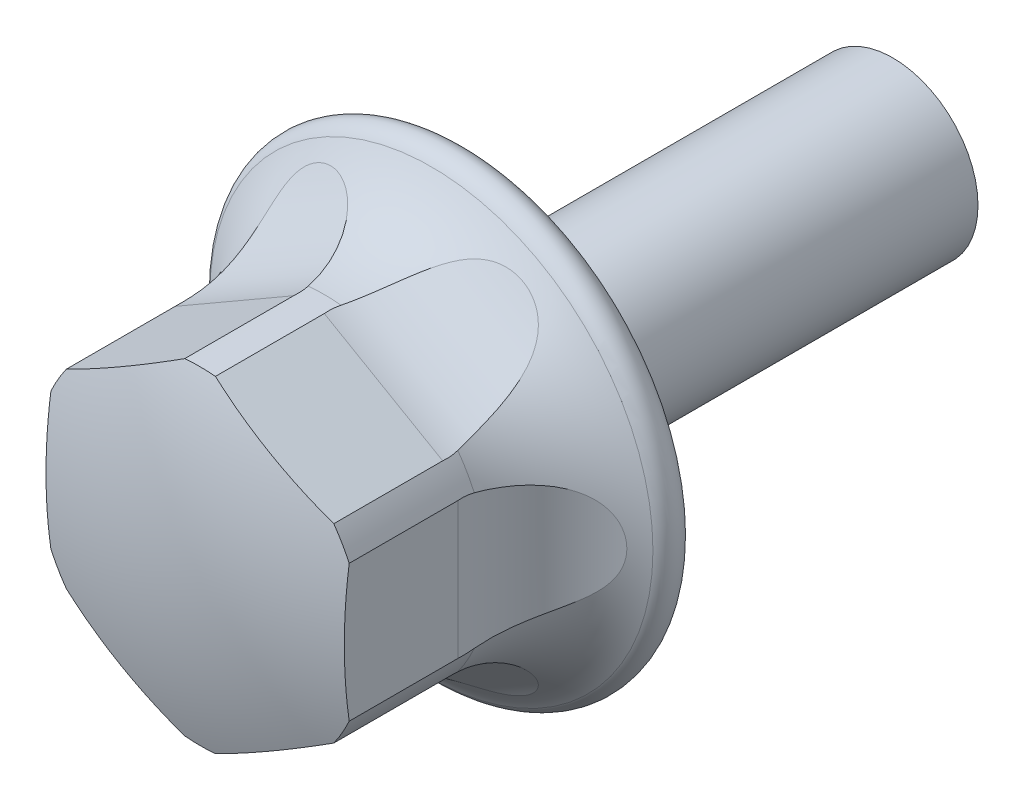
ISO-10303-21;
HEADER;
FILE_DESCRIPTION(('STEP AP214'),'2;1');
FILE_NAME('part.step','',(''),(''),'','','');
FILE_SCHEMA(('AUTOMOTIVE_DESIGN { 1 0 10303 214 1 1 1 1 }'));
ENDSEC;
DATA;
#1=APPLICATION_CONTEXT('core data for automotive mechanical design processes');
#2=APPLICATION_PROTOCOL_DEFINITION('international standard','automotive_design',2000,#1);
#3=PRODUCT_CONTEXT('',#1,'mechanical');
#4=PRODUCT('Part','Part','',(#3));
#5=PRODUCT_RELATED_PRODUCT_CATEGORY('part','',(#4));
#6=PRODUCT_DEFINITION_FORMATION('','',#4);
#7=PRODUCT_DEFINITION_CONTEXT('part definition',#1,'design');
#8=PRODUCT_DEFINITION('design','',#6,#7);
#9=PRODUCT_DEFINITION_SHAPE('','',#8);
#10=(LENGTH_UNIT() NAMED_UNIT(*) SI_UNIT(.MILLI.,.METRE.));
#11=(NAMED_UNIT(*) PLANE_ANGLE_UNIT() SI_UNIT($,.RADIAN.));
#12=(NAMED_UNIT(*) SI_UNIT($,.STERADIAN.) SOLID_ANGLE_UNIT());
#13=UNCERTAINTY_MEASURE_WITH_UNIT(LENGTH_MEASURE(1.E-05),#10,'distance_accuracy_value','');
#14=(GEOMETRIC_REPRESENTATION_CONTEXT(3) GLOBAL_UNCERTAINTY_ASSIGNED_CONTEXT((#13)) GLOBAL_UNIT_ASSIGNED_CONTEXT((#10,
#11,#12)) REPRESENTATION_CONTEXT('',''));
#15=CARTESIAN_POINT('',(0.,0.,0.));
#16=DIRECTION('',(0.,0.,1.));
#17=DIRECTION('',(1.,0.,0.));
#18=AXIS2_PLACEMENT_3D('',#15,#16,#17);
#19=CARTESIAN_POINT('',(0.,0.,0.));
#20=DIRECTION('',(0.,0.,1.));
#21=DIRECTION('',(1.,0.,0.));
#22=AXIS2_PLACEMENT_3D('',#19,#20,#21);
#23=CYLINDRICAL_SURFACE('',#22,3.85);
#24=DIRECTION('',(0.,0.,1.));
#25=VECTOR('',#24,1.);
#26=CARTESIAN_POINT('',(0.360980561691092,3.8330396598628,0.));
#27=LINE('',#26,#25);
#28=CARTESIAN_POINT('',(0.360980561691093,3.8330396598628,3.7));
#29=VERTEX_POINT('',#28);
#30=CARTESIAN_POINT('',(0.360980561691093,3.8330396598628,6.25454860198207));
#31=VERTEX_POINT('',#30);
#32=EDGE_CURVE('E282',#29,#31,#27,.T.);
#33=ORIENTED_EDGE('',*,*,#32,.F.);
#34=CARTESIAN_POINT('',(3.14133213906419,2.22587789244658,3.6));
#35=CARTESIAN_POINT('',(3.14132972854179,2.22588680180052,3.67209261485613));
#36=CARTESIAN_POINT('',(3.13772805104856,2.23099205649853,3.74427829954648));
#37=CARTESIAN_POINT('',(3.12329618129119,2.25114755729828,3.8866251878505));
#38=CARTESIAN_POINT('',(3.11244895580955,2.26622123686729,3.95678121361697));
#39=CARTESIAN_POINT('',(3.0835648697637,2.30536630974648,4.09278988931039));
#40=CARTESIAN_POINT('',(3.06554520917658,2.3294161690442,4.15865239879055));
#41=CARTESIAN_POINT('',(3.02242675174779,2.38509307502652,4.28453173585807));
#42=CARTESIAN_POINT('',(2.99733125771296,2.4167165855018,4.344551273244));
#43=CARTESIAN_POINT('',(2.93955899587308,2.48668377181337,4.45899291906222));
#44=CARTESIAN_POINT('',(2.90670406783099,2.52517918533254,4.51323167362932));
#45=CARTESIAN_POINT('',(2.834218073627,2.60627411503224,4.61347454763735));
#46=CARTESIAN_POINT('',(2.79458433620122,2.64887524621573,4.65947540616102));
#47=CARTESIAN_POINT('',(2.70521902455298,2.74020561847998,4.74668734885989));
#48=CARTESIAN_POINT('',(2.65489561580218,2.7891390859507,4.78707640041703));
#49=CARTESIAN_POINT('',(2.5477903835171,2.88730860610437,4.85760178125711));
#50=CARTESIAN_POINT('',(2.49100544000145,2.93654479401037,4.88773312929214));
#51=CARTESIAN_POINT('',(2.36485016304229,3.03930226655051,4.94098195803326));
#52=CARTESIAN_POINT('',(2.29478688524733,3.09263171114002,4.96282947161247));
#53=CARTESIAN_POINT('',(2.14930325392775,3.19545725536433,4.994345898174));
#54=CARTESIAN_POINT('',(2.07388008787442,3.2449513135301,5.0040083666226));
#55=CARTESIAN_POINT('',(1.91182641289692,3.34323636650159,5.01171324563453));
#56=CARTESIAN_POINT('',(1.82481601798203,3.39150087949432,5.00854732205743));
#57=CARTESIAN_POINT('',(1.64867265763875,3.48053494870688,4.98772705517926));
#58=CARTESIAN_POINT('',(1.55953898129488,3.52130195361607,4.97006779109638));
#59=CARTESIAN_POINT('',(1.3806473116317,3.59524964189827,4.9194149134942));
#60=CARTESIAN_POINT('',(1.29090203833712,3.62829894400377,4.88618119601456));
#61=CARTESIAN_POINT('',(1.11607614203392,3.68582821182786,4.80375685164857));
#62=CARTESIAN_POINT('',(1.03099276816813,3.71031327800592,4.75457575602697));
#63=CARTESIAN_POINT('',(0.876776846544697,3.74961025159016,4.64496546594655));
#64=CARTESIAN_POINT('',(0.806906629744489,3.76505601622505,4.58580750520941));
#65=CARTESIAN_POINT('',(0.678931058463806,3.7902259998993,4.45487866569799));
#66=CARTESIAN_POINT('',(0.620813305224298,3.79995626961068,4.38312123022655));
#67=CARTESIAN_POINT('',(0.526577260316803,3.81407903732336,4.23906105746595));
#68=CARTESIAN_POINT('',(0.488584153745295,3.81899981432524,4.16803379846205));
#69=CARTESIAN_POINT('',(0.426275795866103,3.82645839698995,4.02009144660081));
#70=CARTESIAN_POINT('',(0.401953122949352,3.8289974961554,3.94317957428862));
#71=CARTESIAN_POINT('',(0.369819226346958,3.83222761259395,3.79338854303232));
#72=CARTESIAN_POINT('',(0.36069113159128,3.83306758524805,3.72079246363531));
#73=CARTESIAN_POINT('',(0.355138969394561,3.83358665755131,3.57511986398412));
#74=CARTESIAN_POINT('',(0.358711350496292,3.83326608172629,3.50204348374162));
#75=CARTESIAN_POINT('',(0.378082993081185,3.83140185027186,3.35993726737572));
#76=CARTESIAN_POINT('',(0.393488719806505,3.82989752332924,3.29085270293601));
#77=CARTESIAN_POINT('',(0.43541385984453,3.82535691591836,3.15620987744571));
#78=CARTESIAN_POINT('',(0.461932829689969,3.82232069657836,3.09065147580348));
#79=CARTESIAN_POINT('',(0.525482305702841,3.8141059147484,2.9637516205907));
#80=CARTESIAN_POINT('',(0.562666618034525,3.80889545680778,2.90248951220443));
#81=CARTESIAN_POINT('',(0.645851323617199,3.79567451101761,2.78663451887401));
#82=CARTESIAN_POINT('',(0.691853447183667,3.78766347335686,2.73204294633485));
#83=CARTESIAN_POINT('',(0.793941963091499,3.76762742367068,2.62730956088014));
#84=CARTESIAN_POINT('',(0.850472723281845,3.75538709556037,2.57764331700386));
#85=CARTESIAN_POINT('',(0.969298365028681,3.72648654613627,2.48733296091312));
#86=CARTESIAN_POINT('',(1.03159558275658,3.70982452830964,2.44669252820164));
#87=CARTESIAN_POINT('',(1.16665056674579,3.66972569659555,2.37073273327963));
#88=CARTESIAN_POINT('',(1.23981909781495,3.64576027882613,2.33642416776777));
#89=CARTESIAN_POINT('',(1.38823431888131,3.59187298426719,2.27873434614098));
#90=CARTESIAN_POINT('',(1.46348205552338,3.56194805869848,2.25535870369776));
#91=CARTESIAN_POINT('',(1.62292979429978,3.49242319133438,2.21708076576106));
#92=CARTESIAN_POINT('',(1.70713440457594,3.45209709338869,2.2035101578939));
#93=CARTESIAN_POINT('',(1.87322046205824,3.36487137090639,2.18933908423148));
#94=CARTESIAN_POINT('',(1.95510068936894,3.31796836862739,2.18874530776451));
#95=CARTESIAN_POINT('',(2.1203235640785,3.21509841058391,2.20095385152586));
#96=CARTESIAN_POINT('',(2.2033417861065,3.15872083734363,2.21473059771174));
#97=CARTESIAN_POINT('',(2.36220399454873,3.04174621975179,2.25758442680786));
#98=CARTESIAN_POINT('',(2.43804730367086,2.9811487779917,2.28666295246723));
#99=CARTESIAN_POINT('',(2.57902416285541,2.85999818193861,2.3599068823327));
#100=CARTESIAN_POINT('',(2.64434850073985,2.79947059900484,2.40374408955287));
#101=CARTESIAN_POINT('',(2.76433887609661,2.68104952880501,2.50686671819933));
#102=CARTESIAN_POINT('',(2.81901589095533,2.62315337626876,2.56613608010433));
#103=CARTESIAN_POINT('',(2.9109311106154,2.52055788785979,2.69208328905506));
#104=CARTESIAN_POINT('',(2.94942597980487,2.47510744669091,2.75722909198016));
#105=CARTESIAN_POINT('',(3.01615970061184,2.39334071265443,2.89778338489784));
#106=CARTESIAN_POINT('',(3.0444018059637,2.35702152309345,2.97318860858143));
#107=CARTESIAN_POINT('',(3.08744702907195,2.30027918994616,3.12193102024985));
#108=CARTESIAN_POINT('',(3.10347518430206,2.27845103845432,3.19438350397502));
#109=CARTESIAN_POINT('',(3.12728289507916,2.24566806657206,3.3428671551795));
#110=CARTESIAN_POINT('',(3.13508644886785,2.23468161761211,3.41888723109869));
#111=CARTESIAN_POINT('',(3.14049004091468,2.22706492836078,3.53018309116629));
#112=CARTESIAN_POINT('',(3.14133330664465,2.2258735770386,3.56508062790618));
#113=CARTESIAN_POINT('',(3.14133213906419,2.22587789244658,3.6));
#114=B_SPLINE_CURVE_WITH_KNOTS('',3,(#34,#35,#36,#37,#38,#39,#40,#41,#42,#43,#44,#45,#46,#47,
#48,#49,#50,#51,#52,#53,#54,#55,#56,#57,#58,#59,#60,#61,#62,#63,#64,#65,#66,#67,#68,#69,#70,#71,
#72,#73,#74,#75,#76,#77,#78,#79,#80,#81,#82,#83,#84,#85,#86,#87,#88,#89,#90,#91,#92,#93,#94,#95,
#96,#97,#98,#99,#100,#101,#102,#103,#104,#105,#106,#107,#108,#109,#110,#111,#112,#113),
.UNSPECIFIED.,.T.,.F.,(4,2,2,2,2,2,2,2,2,2,2,2,2,2,2,2,2,2,2,2,2,2,2,2,2,2,2,2,2,2,2,2,2,2,2,2,
2,2,2,4),(0.,0.216172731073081,0.432855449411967,0.64902164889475,0.865087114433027,
1.08670191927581,1.3084042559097,1.55036947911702,1.79245203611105,2.06348945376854,
2.33467016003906,2.63195985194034,2.92935052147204,3.23148484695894,3.5334389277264,
3.81034897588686,4.08696534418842,4.32773862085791,4.56838105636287,4.78681066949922,
5.00517920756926,5.21658420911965,5.42798077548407,5.64259400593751,5.85724939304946,
6.08501804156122,6.3128793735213,6.56473225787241,6.81671431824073,7.09854455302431,
7.38052006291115,7.68294063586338,7.9853897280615,8.28151430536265,8.57733194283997,
8.84061034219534,9.10380511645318,9.33465462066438,9.56482865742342,9.66953586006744),.UNSPECIFIED.);
#115=CARTESIAN_POINT('',(0.38626604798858,3.83057417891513,3.33));
#116=VERTEX_POINT('',#115);
#117=EDGE_CURVE('E354',#29,#116,#114,.T.);
#118=ORIENTED_EDGE('',*,*,#117,.T.);
#119=CARTESIAN_POINT('',(0.,0.,3.33));
#120=DIRECTION('',(0.,0.,1.));
#121=DIRECTION('',(1.,0.,0.));
#122=AXIS2_PLACEMENT_3D('',#119,#120,#121);
#123=CIRCLE('',#122,3.85);
#124=CARTESIAN_POINT('',(-0.386266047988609,3.83057417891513,3.33));
#125=VERTEX_POINT('',#124);
#126=EDGE_CURVE('E265',#116,#125,#123,.T.);
#127=ORIENTED_EDGE('',*,*,#126,.T.);
#128=CARTESIAN_POINT('',(-0.357000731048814,3.83341238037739,3.6));
#129=CARTESIAN_POINT('',(-0.357009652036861,3.83341474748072,3.67209261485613));
#130=CARTESIAN_POINT('',(-0.36323177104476,3.83284823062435,3.74427829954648));
#131=CARTESIAN_POINT('',(-0.387902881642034,3.83042761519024,3.8866251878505));
#132=CARTESIAN_POINT('',(-0.406380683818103,3.82857048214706,3.95678121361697));
#133=CARTESIAN_POINT('',(-0.454723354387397,3.82312866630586,4.09278988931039));
#134=CARTESIAN_POINT('',(-0.484560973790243,3.8195481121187,4.15865239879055));
#135=CARTESIAN_POINT('',(-0.554337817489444,3.81004488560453,4.28453173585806));
#136=CARTESIAN_POINT('',(-0.594272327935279,3.80412330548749,4.34455127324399));
#137=CARTESIAN_POINT('',(-0.683751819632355,3.78907465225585,4.45899291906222));
#138=CARTESIAN_POINT('',(-0.733517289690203,3.77986915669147,4.51323167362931));
#139=CARTESIAN_POINT('',(-0.839990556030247,3.75764190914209,4.61347454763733));
#140=CARTESIAN_POINT('',(-0.896701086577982,3.74461865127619,4.65947540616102));
#141=CARTESIAN_POINT('',(-1.02047816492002,3.71289120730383,4.74668734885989));
#142=CARTESIAN_POINT('',(-1.08801749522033,3.69377659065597,4.78707640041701));
#143=CARTESIAN_POINT('',(-1.22658740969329,3.65010549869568,4.85760178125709));
#144=CARTESIAN_POINT('',(-1.29761967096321,3.62554638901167,4.88773312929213));
#145=CARTESIAN_POINT('',(-1.44968789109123,3.56767145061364,4.94098195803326));
#146=CARTESIAN_POINT('',(-1.53090418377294,3.53365959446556,4.96282947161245));
#147=CARTESIAN_POINT('',(-1.69269553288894,3.45907984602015,4.99434589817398));
#148=CARTESIAN_POINT('',(-1.77327022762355,3.41850849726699,5.0040083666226));
#149=CARTESIAN_POINT('',(-1.9394144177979,3.3273084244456,5.01171324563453));
#150=CARTESIAN_POINT('',(-2.02471790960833,3.27608746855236,5.00854732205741));
#151=CARTESIAN_POINT('',(-2.18989535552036,3.16805987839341,4.98772705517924));
#152=CARTESIAN_POINT('',(-2.26976745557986,3.1112513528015,4.97006779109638));
#153=CARTESIAN_POINT('',(-2.42325386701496,2.99330046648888,4.9194149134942));
#154=CARTESIAN_POINT('',(-2.49674803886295,2.93210343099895,4.88618119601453));
#155=CARTESIAN_POINT('',(-2.63398279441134,2.80946439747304,4.80375685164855));
#156=CARTESIAN_POINT('',(-2.69772917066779,2.7480225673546,4.75457575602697));
#157=CARTESIAN_POINT('',(-2.80886930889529,2.6341161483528,4.64496546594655));
#158=CARTESIAN_POINT('',(-2.85718084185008,2.58132964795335,4.5858075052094));
#159=CARTESIAN_POINT('',(-2.94296647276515,2.48308454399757,4.45487866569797));
#160=CARTESIAN_POINT('',(-2.98045201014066,2.43761822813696,4.38312123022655));
#161=CARTESIAN_POINT('',(-3.03980070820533,2.36306880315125,4.23906105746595));
#162=CARTESIAN_POINT('',(-3.06305877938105,2.33262619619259,4.16803379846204));
#163=CARTESIAN_POINT('',(-3.10067228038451,2.28239486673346,4.0200914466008));
#164=CARTESIAN_POINT('',(-3.11503254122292,2.26260036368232,3.94317957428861));
#165=CARTESIAN_POINT('',(-3.13389685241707,2.23638665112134,3.79338854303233));
#166=CARTESIAN_POINT('',(-3.13918833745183,2.22890147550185,3.72079246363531));
#167=CARTESIAN_POINT('',(-3.14241394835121,2.22435269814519,3.57511986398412));
#168=CARTESIAN_POINT('',(-3.14035013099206,2.22728618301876,3.50204348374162));
#169=CARTESIAN_POINT('',(-3.12904983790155,2.24313040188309,3.35993726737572));
#170=CARTESIAN_POINT('',(-3.12004418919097,2.25571998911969,3.29085270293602));
#171=CARTESIAN_POINT('',(-3.09514933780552,2.2897579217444,3.15620987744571));
#172=CARTESIAN_POINT('',(-3.0792604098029,2.31120591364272,3.09065147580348));
#173=CARTESIAN_POINT('',(-3.04037146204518,2.36213398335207,2.9637516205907));
#174=CARTESIAN_POINT('',(-3.0172669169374,2.39173131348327,2.90248951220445));
#175=CARTESIAN_POINT('',(-2.96422488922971,2.45716090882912,2.78663451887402));
#176=CARTESIAN_POINT('',(-2.93428606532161,2.49299439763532,2.73204294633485));
#177=CARTESIAN_POINT('',(-2.86589007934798,2.57138762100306,2.62730956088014));
#178=CARTESIAN_POINT('',(-2.82702426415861,2.614224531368,2.57764331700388));
#179=CARTESIAN_POINT('',(-2.7425828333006,2.7026802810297,2.48733296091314));
#180=CARTESIAN_POINT('',(-2.69700449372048,2.74830024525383,2.44669252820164));
#181=CARTESIAN_POINT('',(-2.5947503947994,2.84521187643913,2.37073273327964));
#182=CARTESIAN_POINT('',(-2.5374114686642,2.89659497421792,2.33642416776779));
#183=CARTESIAN_POINT('',(-2.41653609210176,2.99818267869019,2.278734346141));
#184=CARTESIAN_POINT('',(-2.35299647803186,3.04838666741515,2.25535870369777));
#185=CARTESIAN_POINT('',(-2.21306230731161,3.15171002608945,2.21708076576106));
#186=CARTESIAN_POINT('',(-2.13603657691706,3.20447030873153,2.20351015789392));
#187=CARTESIAN_POINT('',(-1.9774538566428,3.30469219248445,2.1893390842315));
#188=CARTESIAN_POINT('',(-1.89589455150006,3.35215104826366,2.18874530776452));
#189=CARTESIAN_POINT('',(-1.7241951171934,3.44380327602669,2.20095385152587));
#190=CARTESIAN_POINT('',(-1.6338615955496,3.48751037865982,2.21473059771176));
#191=CARTESIAN_POINT('',(-1.45312750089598,3.56660177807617,2.25758442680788));
#192=CARTESIAN_POINT('',(-1.36272692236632,3.60198528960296,2.28666295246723));
#193=CARTESIAN_POINT('',(-1.18731899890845,3.66349953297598,2.3599068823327));
#194=CARTESIAN_POINT('',(-1.10223840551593,3.68980827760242,2.40374408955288));
#195=CARTESIAN_POINT('',(-0.939687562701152,3.73451245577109,2.50686671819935));
#196=CARTESIAN_POINT('',(-0.862209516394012,3.75291606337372,2.56613608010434));
#197=CARTESIAN_POINT('',(-0.727401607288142,3.78121923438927,2.69208328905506));
#198=CARTESIAN_POINT('',(-0.668792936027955,3.79183154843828,2.75722909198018));
#199=CARTESIAN_POINT('',(-0.56461400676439,3.80874127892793,2.89778338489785));
#200=CARTESIAN_POINT('',(-0.519039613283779,3.81504006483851,2.97318860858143));
#201=CARTESIAN_POINT('',(-0.448376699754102,3.82394715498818,3.12193102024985));
#202=CARTESIAN_POINT('',(-0.421458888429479,3.82691386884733,3.19438350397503));
#203=CARTESIAN_POINT('',(-0.381164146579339,3.83114046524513,3.34286715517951));
#204=CARTESIAN_POINT('',(-0.367747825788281,3.83240531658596,3.41888723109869));
#205=CARTESIAN_POINT('',(-0.35844978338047,3.83327661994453,3.53018309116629));
#206=CARTESIAN_POINT('',(-0.356996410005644,3.83341123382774,3.56508062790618));
#207=CARTESIAN_POINT('',(-0.357000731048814,3.83341238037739,3.6));
#208=B_SPLINE_CURVE_WITH_KNOTS('',3,(#128,#129,#130,#131,#132,#133,#134,#135,#136,#137,#138,
#139,#140,#141,#142,#143,#144,#145,#146,#147,#148,#149,#150,#151,#152,#153,#154,#155,#156,#157,
#158,#159,#160,#161,#162,#163,#164,#165,#166,#167,#168,#169,#170,#171,#172,#173,#174,#175,#176,
#177,#178,#179,#180,#181,#182,#183,#184,#185,#186,#187,#188,#189,#190,#191,#192,#193,#194,#195,
#196,#197,#198,#199,#200,#201,#202,#203,#204,#205,#206,#207),.UNSPECIFIED.,.T.,.F.,(4,2,2,2,2,2,
2,2,2,2,2,2,2,2,2,2,2,2,2,2,2,2,2,2,2,2,2,2,2,2,2,2,2,2,2,2,2,2,2,4),(0.,0.21617273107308,
0.432855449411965,0.649021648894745,0.865087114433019,1.0867019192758,1.30840425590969,
1.550369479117,1.79245203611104,2.06348945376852,2.33467016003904,2.63195985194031,
2.92935052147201,3.23148484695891,3.53343892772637,3.81034897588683,4.08696534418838,
4.32773862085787,4.56838105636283,4.78681066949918,5.00517920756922,5.2165842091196,
5.42798077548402,5.64259400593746,5.8572493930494,6.08501804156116,6.31287937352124,
6.56473225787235,6.81671431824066,7.09854455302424,7.38052006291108,7.68294063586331,
7.98538972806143,8.28151430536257,8.57733194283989,8.84061034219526,9.10380511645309,
9.33465462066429,9.56482865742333,9.66953586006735),.UNSPECIFIED.);
#209=CARTESIAN_POINT('',(-0.360980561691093,3.83303965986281,3.7));
#210=VERTEX_POINT('',#209);
#211=EDGE_CURVE('E394',#125,#210,#208,.T.);
#212=ORIENTED_EDGE('',*,*,#211,.T.);
#213=DIRECTION('',(0.,0.,1.));
#214=VECTOR('',#213,1.);
#215=CARTESIAN_POINT('',(-0.360980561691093,3.8330396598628,0.));
#216=LINE('',#215,#214);
#217=CARTESIAN_POINT('',(-0.360980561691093,3.83303965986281,6.25454860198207));
#218=VERTEX_POINT('',#217);
#219=EDGE_CURVE('E285',#218,#210,#216,.F.);
#220=ORIENTED_EDGE('',*,*,#219,.F.);
#221=CARTESIAN_POINT('',(0.,0.,6.25454860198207));
#222=DIRECTION('',(0.,0.,1.));
#223=DIRECTION('',(1.,0.,0.));
#224=AXIS2_PLACEMENT_3D('',#221,#222,#223);
#225=CIRCLE('',#224,3.85);
#226=EDGE_CURVE('E278',#31,#218,#225,.T.);
#227=ORIENTED_EDGE('',*,*,#226,.F.);
#228=EDGE_LOOP('',(#33,#118,#127,#212,#220,#227));
#229=FACE_BOUND('',#228,.T.);
#230=ADVANCED_FACE('F16',(#229),#23,.T.);
#231=DIRECTION('',(0.,0.,1.));
#232=VECTOR('',#231,1.);
#233=CARTESIAN_POINT('',(3.13901943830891,-2.22913816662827,0.));
#234=LINE('',#233,#232);
#235=CARTESIAN_POINT('',(3.13901943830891,-2.22913816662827,3.7));
#236=VERTEX_POINT('',#235);
#237=CARTESIAN_POINT('',(3.13901943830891,-2.22913816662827,6.25454860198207));
#238=VERTEX_POINT('',#237);
#239=EDGE_CURVE('E172',#236,#238,#234,.T.);
#240=ORIENTED_EDGE('',*,*,#239,.F.);
#241=CARTESIAN_POINT('',(0.357000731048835,-3.83341238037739,3.6));
#242=CARTESIAN_POINT('',(0.357009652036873,-3.83341474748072,3.67209261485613));
#243=CARTESIAN_POINT('',(0.363231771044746,-3.83284823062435,3.74427829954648));
#244=CARTESIAN_POINT('',(0.387902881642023,-3.83042761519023,3.8866251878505));
#245=CARTESIAN_POINT('',(0.406380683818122,-3.82857048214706,3.95678121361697));
#246=CARTESIAN_POINT('',(0.454723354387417,-3.82312866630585,4.09278988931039));
#247=CARTESIAN_POINT('',(0.484560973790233,-3.8195481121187,4.15865239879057));
#248=CARTESIAN_POINT('',(0.554337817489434,-3.81004488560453,4.28453173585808));
#249=CARTESIAN_POINT('',(0.594272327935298,-3.80412330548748,4.34455127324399));
#250=CARTESIAN_POINT('',(0.68375181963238,-3.78907465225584,4.45899291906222));
#251=CARTESIAN_POINT('',(0.733517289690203,-3.77986915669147,4.51323167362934));
#252=CARTESIAN_POINT('',(0.839990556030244,-3.75764190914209,4.61347454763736));
#253=CARTESIAN_POINT('',(0.896701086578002,-3.74461865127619,4.65947540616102));
#254=CARTESIAN_POINT('',(1.02047816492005,-3.71289120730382,4.74668734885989));
#255=CARTESIAN_POINT('',(1.08801749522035,-3.69377659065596,4.78707640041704));
#256=CARTESIAN_POINT('',(1.22658740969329,-3.65010549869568,4.85760178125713));
#257=CARTESIAN_POINT('',(1.29761967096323,-3.62554638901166,4.88773312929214));
#258=CARTESIAN_POINT('',(1.44968789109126,-3.56767145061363,4.94098195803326));
#259=CARTESIAN_POINT('',(1.53090418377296,-3.53365959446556,4.96282947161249));
#260=CARTESIAN_POINT('',(1.69269553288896,-3.45907984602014,4.99434589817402));
#261=CARTESIAN_POINT('',(1.77327022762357,-3.41850849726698,5.0040083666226));
#262=CARTESIAN_POINT('',(1.93941441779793,-3.32730842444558,5.01171324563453));
#263=CARTESIAN_POINT('',(2.02471790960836,-3.27608746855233,5.00854732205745));
#264=CARTESIAN_POINT('',(2.18989535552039,-3.16805987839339,4.98772705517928));
#265=CARTESIAN_POINT('',(2.26976745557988,-3.11125135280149,4.97006779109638));
#266=CARTESIAN_POINT('',(2.42325386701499,-2.99330046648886,4.9194149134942));
#267=CARTESIAN_POINT('',(2.496748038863,-2.93210343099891,4.88618119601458));
#268=CARTESIAN_POINT('',(2.63398279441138,-2.809464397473,4.80375685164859));
#269=CARTESIAN_POINT('',(2.6977291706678,-2.74802256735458,4.75457575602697));
#270=CARTESIAN_POINT('',(2.80886930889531,-2.63411614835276,4.64496546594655));
#271=CARTESIAN_POINT('',(2.85718084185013,-2.58132964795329,4.58580750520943));
#272=CARTESIAN_POINT('',(2.9429664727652,-2.48308454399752,4.45487866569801));
#273=CARTESIAN_POINT('',(2.98045201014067,-2.43761822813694,4.38312123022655));
#274=CARTESIAN_POINT('',(3.03980070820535,-2.36306880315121,4.23906105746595));
#275=CARTESIAN_POINT('',(3.06305877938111,-2.33262619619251,4.16803379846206));
#276=CARTESIAN_POINT('',(3.10067228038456,-2.2823948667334,4.02009144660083));
#277=CARTESIAN_POINT('',(3.11503254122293,-2.2626003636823,3.94317957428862));
#278=CARTESIAN_POINT('',(3.13389685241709,-2.23638665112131,3.79338854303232));
#279=CARTESIAN_POINT('',(3.13918833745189,-2.22890147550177,3.72079246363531));
#280=CARTESIAN_POINT('',(3.14241394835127,-2.22435269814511,3.57511986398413));
#281=CARTESIAN_POINT('',(3.14035013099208,-2.22728618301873,3.50204348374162));
#282=CARTESIAN_POINT('',(3.12904983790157,-2.24313040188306,3.35993726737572));
#283=CARTESIAN_POINT('',(3.12004418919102,-2.25571998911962,3.290852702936));
#284=CARTESIAN_POINT('',(3.09514933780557,-2.28975792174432,3.1562098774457));
#285=CARTESIAN_POINT('',(3.07926040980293,-2.31120591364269,3.09065147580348));
#286=CARTESIAN_POINT('',(3.0403714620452,-2.36213398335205,2.9637516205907));
#287=CARTESIAN_POINT('',(3.01726691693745,-2.39173131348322,2.90248951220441));
#288=CARTESIAN_POINT('',(2.96422488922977,-2.45716090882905,2.78663451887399));
#289=CARTESIAN_POINT('',(2.93428606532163,-2.49299439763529,2.73204294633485));
#290=CARTESIAN_POINT('',(2.86589007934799,-2.57138762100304,2.62730956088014));
#291=CARTESIAN_POINT('',(2.82702426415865,-2.61422453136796,2.57764331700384));
#292=CARTESIAN_POINT('',(2.74258283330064,-2.70268028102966,2.4873329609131));
#293=CARTESIAN_POINT('',(2.69700449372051,-2.7483002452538,2.44669252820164));
#294=CARTESIAN_POINT('',(2.59475039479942,-2.84521187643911,2.37073273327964));
#295=CARTESIAN_POINT('',(2.53741146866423,-2.89659497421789,2.33642416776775));
#296=CARTESIAN_POINT('',(2.41653609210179,-2.99818267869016,2.27873434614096));
#297=CARTESIAN_POINT('',(2.35299647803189,-3.04838666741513,2.25535870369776));
#298=CARTESIAN_POINT('',(2.21306230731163,-3.15171002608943,2.21708076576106));
#299=CARTESIAN_POINT('',(2.13603657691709,-3.20447030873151,2.20351015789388));
#300=CARTESIAN_POINT('',(1.97745385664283,-3.30469219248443,2.18933908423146));
#301=CARTESIAN_POINT('',(1.89589455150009,-3.35215104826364,2.18874530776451));
#302=CARTESIAN_POINT('',(1.72419511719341,-3.44380327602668,2.20095385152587));
#303=CARTESIAN_POINT('',(1.63386159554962,-3.48751037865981,2.21473059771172));
#304=CARTESIAN_POINT('',(1.45312750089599,-3.56660177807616,2.25758442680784));
#305=CARTESIAN_POINT('',(1.36272692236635,-3.60198528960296,2.28666295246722));
#306=CARTESIAN_POINT('',(1.18731899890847,-3.66349953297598,2.35990688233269));
#307=CARTESIAN_POINT('',(1.10223840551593,-3.68980827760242,2.40374408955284));
#308=CARTESIAN_POINT('',(0.93968756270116,-3.73451245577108,2.50686671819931));
#309=CARTESIAN_POINT('',(0.862209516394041,-3.75291606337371,2.56613608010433));
#310=CARTESIAN_POINT('',(0.727401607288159,-3.78121923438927,2.69208328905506));
#311=CARTESIAN_POINT('',(0.668792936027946,-3.79183154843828,2.75722909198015));
#312=CARTESIAN_POINT('',(0.564614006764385,-3.80874127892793,2.89778338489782));
#313=CARTESIAN_POINT('',(0.519039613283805,-3.8150400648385,2.97318860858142));
#314=CARTESIAN_POINT('',(0.448376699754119,-3.82394715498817,3.12193102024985));
#315=CARTESIAN_POINT('',(0.421458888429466,-3.82691386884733,3.19438350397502));
#316=CARTESIAN_POINT('',(0.381164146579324,-3.83114046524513,3.34286715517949));
#317=CARTESIAN_POINT('',(0.367747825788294,-3.83240531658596,3.41888723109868));
#318=CARTESIAN_POINT('',(0.358449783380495,-3.83327661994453,3.53018309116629));
#319=CARTESIAN_POINT('',(0.356996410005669,-3.83341123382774,3.56508062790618));
#320=CARTESIAN_POINT('',(0.357000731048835,-3.83341238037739,3.6));
#321=B_SPLINE_CURVE_WITH_KNOTS('',3,(#241,#242,#243,#244,#245,#246,#247,#248,#249,#250,#251,
#252,#253,#254,#255,#256,#257,#258,#259,#260,#261,#262,#263,#264,#265,#266,#267,#268,#269,#270,
#271,#272,#273,#274,#275,#276,#277,#278,#279,#280,#281,#282,#283,#284,#285,#286,#287,#288,#289,
#290,#291,#292,#293,#294,#295,#296,#297,#298,#299,#300,#301,#302,#303,#304,#305,#306,#307,#308,
#309,#310,#311,#312,#313,#314,#315,#316,#317,#318,#319,#320),.UNSPECIFIED.,.T.,.F.,(4,2,2,2,2,2,
2,2,2,2,2,2,2,2,2,2,2,2,2,2,2,2,2,2,2,2,2,2,2,2,2,2,2,2,2,2,2,2,2,4),(0.,0.216172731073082,
0.432855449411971,0.649021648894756,0.865087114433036,1.08670191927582,1.30840425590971,
1.55036947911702,1.79245203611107,2.06348945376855,2.33467016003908,2.63195985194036,
2.92935052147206,3.23148484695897,3.53343892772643,3.81034897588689,4.08696534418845,
4.32773862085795,4.56838105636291,4.78681066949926,5.00517920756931,5.2165842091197,
5.42798077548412,5.64259400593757,5.85724939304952,6.08501804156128,6.31287937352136,
6.56473225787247,6.81671431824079,7.09854455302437,7.38052006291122,7.68294063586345,
7.98538972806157,8.28151430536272,8.57733194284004,8.84061034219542,9.10380511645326,
9.33465462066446,9.5648286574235,9.66953586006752),.UNSPECIFIED.);
#322=CARTESIAN_POINT('',(3.12424152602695,-2.24980329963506,3.33));
#323=VERTEX_POINT('',#322);
#324=EDGE_CURVE('E147',#236,#323,#321,.T.);
#325=ORIENTED_EDGE('',*,*,#324,.T.);
#326=CARTESIAN_POINT('',(3.51050757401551,-1.58077087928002,3.33));
#327=VERTEX_POINT('',#326);
#328=EDGE_CURVE('E267',#323,#327,#123,.T.);
#329=ORIENTED_EDGE('',*,*,#328,.T.);
#330=CARTESIAN_POINT('',(3.51050757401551,-1.58077087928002,3.33));
#331=CARTESIAN_POINT('',(3.50736845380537,-1.58773583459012,3.36470736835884));
#332=CARTESIAN_POINT('',(3.50481753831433,-1.59335256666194,3.39972194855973));
#333=CARTESIAN_POINT('',(3.50093735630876,-1.60186234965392,3.47014589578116));
#334=CARTESIAN_POINT('',(3.4996080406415,-1.6047555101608,3.50555524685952));
#335=CARTESIAN_POINT('',(3.49752355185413,-1.60930179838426,3.61187097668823));
#336=CARTESIAN_POINT('',(3.4986555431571,-1.60685714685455,3.68304252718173));
#337=CARTESIAN_POINT('',(3.50586673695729,-1.59105899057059,3.82390497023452));
#338=CARTESIAN_POINT('',(3.51194853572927,-1.57769976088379,3.8935950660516));
#339=CARTESIAN_POINT('',(3.52845398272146,-1.54042986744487,4.02954284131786));
#340=CARTESIAN_POINT('',(3.53887711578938,-1.51652045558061,4.09580092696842));
#341=CARTESIAN_POINT('',(3.56315059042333,-1.45857658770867,4.2236823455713));
#342=CARTESIAN_POINT('',(3.57702732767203,-1.42446372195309,4.28526497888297));
#343=CARTESIAN_POINT('',(3.60685553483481,-1.34714718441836,4.40186488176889));
#344=CARTESIAN_POINT('',(3.62280767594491,-1.30394056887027,4.45688001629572));
#345=CARTESIAN_POINT('',(3.65634404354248,-1.20682786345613,4.56247270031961));
#346=CARTESIAN_POINT('',(3.67396889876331,-1.15243799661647,4.61259120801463));
#347=CARTESIAN_POINT('',(3.70837735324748,-1.03638904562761,4.70387204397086));
#348=CARTESIAN_POINT('',(3.72516066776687,-0.974727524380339,4.74503135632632));
#349=CARTESIAN_POINT('',(3.75817967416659,-0.839015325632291,4.82208960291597));
#350=CARTESIAN_POINT('',(3.77417647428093,-0.764343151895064,4.85699487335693));
#351=CARTESIAN_POINT('',(3.80215781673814,-0.610123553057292,4.91594254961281));
#352=CARTESIAN_POINT('',(3.81414021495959,-0.530573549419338,4.93997915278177));
#353=CARTESIAN_POINT('',(3.83432995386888,-0.358805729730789,4.97972898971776));
#354=CARTESIAN_POINT('',(3.84191909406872,-0.266206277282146,4.99411287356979));
#355=CARTESIAN_POINT('',(3.85031250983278,-0.0795869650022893,5.00998742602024));
#356=CARTESIAN_POINT('',(3.85111328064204,0.0144336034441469,5.01147143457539));
#357=CARTESIAN_POINT('',(3.84565718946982,0.208662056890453,5.00119839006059));
#358=CARTESIAN_POINT('',(3.83886611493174,0.308804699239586,4.98843918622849));
#359=CARTESIAN_POINT('',(3.81798689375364,0.505198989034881,4.94768946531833));
#360=CARTESIAN_POINT('',(3.80389807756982,0.60145027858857,4.91969755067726));
#361=CARTESIAN_POINT('',(3.77021282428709,0.785217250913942,4.84855081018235));
#362=CARTESIAN_POINT('',(3.75071701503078,0.872856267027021,4.80566971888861));
#363=CARTESIAN_POINT('',(3.70846633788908,1.03779381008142,4.70437115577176));
#364=CARTESIAN_POINT('',(3.68571418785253,1.11510085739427,4.64596660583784));
#365=CARTESIAN_POINT('',(3.64264043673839,1.24821797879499,4.52134337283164));
#366=CARTESIAN_POINT('',(3.62232083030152,1.30544628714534,4.45664253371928));
#367=CARTESIAN_POINT('',(3.58432807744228,1.40641866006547,4.31679483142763));
#368=CARTESIAN_POINT('',(3.56665206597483,1.45017737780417,4.24165944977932));
#369=CARTESIAN_POINT('',(3.53832905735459,1.51786316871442,4.09330816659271));
#370=CARTESIAN_POINT('',(3.5270804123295,1.54358277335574,4.02102122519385));
#371=CARTESIAN_POINT('',(3.50980666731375,1.58247228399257,3.87254804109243));
#372=CARTESIAN_POINT('',(3.50377955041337,1.59564703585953,3.79636331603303));
#373=CARTESIAN_POINT('',(3.49812117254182,1.60800549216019,3.65449602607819));
#374=CARTESIAN_POINT('',(3.49764727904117,1.60903269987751,3.58900466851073));
#375=CARTESIAN_POINT('',(3.50012573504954,1.60362722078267,3.49126749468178));
#376=CARTESIAN_POINT('',(3.50148511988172,1.60066401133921,3.45875338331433));
#377=CARTESIAN_POINT('',(3.50523322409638,1.59243762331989,3.39407203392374));
#378=CARTESIAN_POINT('',(3.50762210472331,1.58717408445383,3.36190485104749));
#379=CARTESIAN_POINT('',(3.51050757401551,1.58077087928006,3.33));
#380=B_SPLINE_CURVE_WITH_KNOTS('',3,(#330,#331,#332,#333,#334,#335,#336,#337,#338,#339,#340,
#341,#342,#343,#344,#345,#346,#347,#348,#349,#350,#351,#352,#353,#354,#355,#356,#357,#358,#359,
#360,#361,#362,#363,#364,#365,#366,#367,#368,#369,#370,#371,#372,#373,#374,#375,#376,#377,#378,
#379),.UNSPECIFIED.,.F.,.F.,(4,2,2,2,2,2,2,2,2,2,2,2,2,2,2,2,2,2,2,2,2,2,2,2,4),(0.,
0.106550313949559,0.213096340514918,0.425650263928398,0.638315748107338,0.850956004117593,
1.06527424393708,1.27966196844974,1.50681041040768,1.73403519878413,1.98491446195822,
2.23592750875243,2.51678405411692,2.79778559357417,3.0998773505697,3.40199682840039,
3.69883275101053,3.99542235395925,4.26008655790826,4.52446181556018,4.75587014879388,
4.98718905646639,5.18285377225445,5.2807976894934,5.37875695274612),.UNSPECIFIED.);
#381=CARTESIAN_POINT('',(3.5,-1.60390149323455,3.7));
#382=VERTEX_POINT('',#381);
#383=EDGE_CURVE('E325',#327,#382,#380,.T.);
#384=ORIENTED_EDGE('',*,*,#383,.T.);
#385=DIRECTION('',(0.,0.,1.));
#386=VECTOR('',#385,1.);
#387=CARTESIAN_POINT('',(3.5,-1.60390149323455,0.));
#388=LINE('',#387,#386);
#389=CARTESIAN_POINT('',(3.5,-1.60390149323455,6.25454860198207));
#390=VERTEX_POINT('',#389);
#391=EDGE_CURVE('E179',#390,#382,#388,.F.);
#392=ORIENTED_EDGE('',*,*,#391,.F.);
#393=EDGE_CURVE('E271',#238,#390,#225,.T.);
#394=ORIENTED_EDGE('',*,*,#393,.F.);
#395=EDGE_LOOP('',(#240,#325,#329,#384,#392,#394));
#396=FACE_BOUND('',#395,.T.);
#397=ADVANCED_FACE('F215',(#396),#23,.T.);
#398=CARTESIAN_POINT('',(-0.38626604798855,-3.83057417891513,3.33));
#399=VERTEX_POINT('',#398);
#400=CARTESIAN_POINT('',(0.386266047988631,-3.83057417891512,3.33));
#401=VERTEX_POINT('',#400);
#402=EDGE_CURVE('E164',#399,#401,#123,.T.);
#403=ORIENTED_EDGE('',*,*,#402,.T.);
#404=CARTESIAN_POINT('',(0.360980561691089,-3.83303965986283,3.7));
#405=VERTEX_POINT('',#404);
#406=EDGE_CURVE('E144',#401,#405,#321,.T.);
#407=ORIENTED_EDGE('',*,*,#406,.T.);
#408=DIRECTION('',(0.,0.,1.));
#409=VECTOR('',#408,1.);
#410=CARTESIAN_POINT('',(0.360980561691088,-3.83303965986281,0.));
#411=LINE('',#410,#409);
#412=CARTESIAN_POINT('',(0.360980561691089,-3.8330396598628,6.25454860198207));
#413=VERTEX_POINT('',#412);
#414=EDGE_CURVE('E160',#413,#405,#411,.F.);
#415=ORIENTED_EDGE('',*,*,#414,.F.);
#416=CARTESIAN_POINT('',(-0.360980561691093,-3.83303965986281,6.25454860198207));
#417=VERTEX_POINT('',#416);
#418=EDGE_CURVE('E314',#417,#413,#225,.T.);
#419=ORIENTED_EDGE('',*,*,#418,.F.);
#420=DIRECTION('',(0.,0.,1.));
#421=VECTOR('',#420,1.);
#422=CARTESIAN_POINT('',(-0.360980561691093,-3.8330396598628,0.));
#423=LINE('',#422,#421);
#424=CARTESIAN_POINT('',(-0.360980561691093,-3.83303965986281,3.7));
#425=VERTEX_POINT('',#424);
#426=EDGE_CURVE('E173',#425,#417,#423,.T.);
#427=ORIENTED_EDGE('',*,*,#426,.F.);
#428=CARTESIAN_POINT('',(-3.14133213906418,-2.22587789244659,3.6));
#429=CARTESIAN_POINT('',(-3.14132972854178,-2.22588680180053,3.67209261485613));
#430=CARTESIAN_POINT('',(-3.13772805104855,-2.23099205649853,3.74427829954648));
#431=CARTESIAN_POINT('',(-3.12329618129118,-2.2511475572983,3.8866251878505));
#432=CARTESIAN_POINT('',(-3.11244895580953,-2.26622123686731,3.95678121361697));
#433=CARTESIAN_POINT('',(-3.08356486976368,-2.3053663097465,4.09278988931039));
#434=CARTESIAN_POINT('',(-3.06554520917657,-2.32941616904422,4.15865239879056));
#435=CARTESIAN_POINT('',(-3.02242675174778,-2.38509307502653,4.28453173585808));
#436=CARTESIAN_POINT('',(-2.99733125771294,-2.41671658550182,4.34455127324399));
#437=CARTESIAN_POINT('',(-2.93955899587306,-2.48668377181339,4.45899291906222));
#438=CARTESIAN_POINT('',(-2.90670406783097,-2.52517918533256,4.51323167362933));
#439=CARTESIAN_POINT('',(-2.83421807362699,-2.60627411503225,4.61347454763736));
#440=CARTESIAN_POINT('',(-2.7945843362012,-2.64887524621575,4.65947540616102));
#441=CARTESIAN_POINT('',(-2.70521902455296,-2.74020561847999,4.74668734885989));
#442=CARTESIAN_POINT('',(-2.65489561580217,-2.78913908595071,4.78707640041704));
#443=CARTESIAN_POINT('',(-2.54779038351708,-2.88730860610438,4.85760178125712));
#444=CARTESIAN_POINT('',(-2.49100544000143,-2.93654479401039,4.88773312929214));
#445=CARTESIAN_POINT('',(-2.36485016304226,-3.03930226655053,4.94098195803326));
#446=CARTESIAN_POINT('',(-2.29478688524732,-3.09263171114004,4.96282947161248));
#447=CARTESIAN_POINT('',(-2.14930325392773,-3.19545725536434,4.99434589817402));
#448=CARTESIAN_POINT('',(-2.0738800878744,-3.24495131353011,5.0040083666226));
#449=CARTESIAN_POINT('',(-1.91182641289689,-3.3432363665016,5.01171324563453));
#450=CARTESIAN_POINT('',(-1.824816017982,-3.39150087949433,5.00854732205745));
#451=CARTESIAN_POINT('',(-1.64867265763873,-3.4805349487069,4.98772705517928));
#452=CARTESIAN_POINT('',(-1.55953898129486,-3.52130195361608,4.97006779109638));
#453=CARTESIAN_POINT('',(-1.38064731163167,-3.59524964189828,4.9194149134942));
#454=CARTESIAN_POINT('',(-1.29090203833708,-3.62829894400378,4.88618119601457));
#455=CARTESIAN_POINT('',(-1.11607614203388,-3.68582821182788,4.80375685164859));
#456=CARTESIAN_POINT('',(-1.03099276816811,-3.71031327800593,4.75457575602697));
#457=CARTESIAN_POINT('',(-0.876776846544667,-3.74961025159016,4.64496546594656));
#458=CARTESIAN_POINT('',(-0.806906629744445,-3.76505601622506,4.58580750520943));
#459=CARTESIAN_POINT('',(-0.678931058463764,-3.79022599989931,4.45487866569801));
#460=CARTESIAN_POINT('',(-0.620813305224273,-3.79995626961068,4.38312123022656));
#461=CARTESIAN_POINT('',(-0.526577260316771,-3.81407903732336,4.23906105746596));
#462=CARTESIAN_POINT('',(-0.488584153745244,-3.81899981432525,4.16803379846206));
#463=CARTESIAN_POINT('',(-0.426275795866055,-3.82645839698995,4.02009144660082));
#464=CARTESIAN_POINT('',(-0.401953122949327,-3.8289974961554,3.94317957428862));
#465=CARTESIAN_POINT('',(-0.369819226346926,-3.83222761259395,3.79338854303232));
#466=CARTESIAN_POINT('',(-0.360691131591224,-3.83306758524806,3.72079246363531));
#467=CARTESIAN_POINT('',(-0.355138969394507,-3.83358665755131,3.57511986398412));
#468=CARTESIAN_POINT('',(-0.358711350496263,-3.83326608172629,3.50204348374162));
#469=CARTESIAN_POINT('',(-0.378082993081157,-3.83140185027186,3.35993726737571));
#470=CARTESIAN_POINT('',(-0.393488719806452,-3.82989752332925,3.290852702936));
#471=CARTESIAN_POINT('',(-0.435413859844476,-3.82535691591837,3.1562098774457));
#472=CARTESIAN_POINT('',(-0.461932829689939,-3.82232069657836,3.09065147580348));
#473=CARTESIAN_POINT('',(-0.525482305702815,-3.81410591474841,2.9637516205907));
#474=CARTESIAN_POINT('',(-0.562666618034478,-3.80889545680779,2.90248951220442));
#475=CARTESIAN_POINT('',(-0.64585132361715,-3.79567451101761,2.78663451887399));
#476=CARTESIAN_POINT('',(-0.691853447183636,-3.78766347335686,2.73204294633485));
#477=CARTESIAN_POINT('',(-0.793941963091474,-3.76762742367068,2.62730956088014));
#478=CARTESIAN_POINT('',(-0.850472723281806,-3.75538709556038,2.57764331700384));
#479=CARTESIAN_POINT('',(-0.969298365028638,-3.72648654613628,2.4873329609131));
#480=CARTESIAN_POINT('',(-1.03159558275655,-3.70982452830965,2.44669252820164));
#481=CARTESIAN_POINT('',(-1.16665056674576,-3.66972569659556,2.37073273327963));
#482=CARTESIAN_POINT('',(-1.23981909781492,-3.64576027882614,2.33642416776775));
#483=CARTESIAN_POINT('',(-1.38823431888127,-3.5918729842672,2.27873434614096));
#484=CARTESIAN_POINT('',(-1.46348205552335,-3.56194805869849,2.25535870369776));
#485=CARTESIAN_POINT('',(-1.62292979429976,-3.49242319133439,2.21708076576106));
#486=CARTESIAN_POINT('',(-1.70713440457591,-3.4520970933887,2.20351015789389));
#487=CARTESIAN_POINT('',(-1.87322046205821,-3.36487137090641,2.18933908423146));
#488=CARTESIAN_POINT('',(-1.95510068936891,-3.3179683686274,2.18874530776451));
#489=CARTESIAN_POINT('',(-2.12032356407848,-3.21509841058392,2.20095385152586));
#490=CARTESIAN_POINT('',(-2.20334178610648,-3.15872083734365,2.21473059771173));
#491=CARTESIAN_POINT('',(-2.36220399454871,-3.0417462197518,2.25758442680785));
#492=CARTESIAN_POINT('',(-2.43804730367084,-2.98114877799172,2.28666295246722));
#493=CARTESIAN_POINT('',(-2.5790241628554,-2.85999818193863,2.35990688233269));
#494=CARTESIAN_POINT('',(-2.64434850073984,-2.79947059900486,2.40374408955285));
#495=CARTESIAN_POINT('',(-2.76433887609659,-2.68104952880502,2.50686671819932));
#496=CARTESIAN_POINT('',(-2.81901589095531,-2.62315337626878,2.56613608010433));
#497=CARTESIAN_POINT('',(-2.91093111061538,-2.5205578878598,2.69208328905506));
#498=CARTESIAN_POINT('',(-2.94942597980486,-2.47510744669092,2.75722909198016));
#499=CARTESIAN_POINT('',(-3.01615970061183,-2.39334071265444,2.89778338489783));
#500=CARTESIAN_POINT('',(-3.04440180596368,-2.35702152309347,2.97318860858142));
#501=CARTESIAN_POINT('',(-3.08744702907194,-2.30027918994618,3.12193102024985));
#502=CARTESIAN_POINT('',(-3.10347518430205,-2.27845103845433,3.19438350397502));
#503=CARTESIAN_POINT('',(-3.12728289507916,-2.24566806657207,3.3428671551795));
#504=CARTESIAN_POINT('',(-3.13508644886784,-2.23468161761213,3.41888723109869));
#505=CARTESIAN_POINT('',(-3.14049004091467,-2.2270649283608,3.53018309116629));
#506=CARTESIAN_POINT('',(-3.14133330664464,-2.22587357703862,3.56508062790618));
#507=CARTESIAN_POINT('',(-3.14133213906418,-2.22587789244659,3.6));
#508=B_SPLINE_CURVE_WITH_KNOTS('',3,(#428,#429,#430,#431,#432,#433,#434,#435,#436,#437,#438,
#439,#440,#441,#442,#443,#444,#445,#446,#447,#448,#449,#450,#451,#452,#453,#454,#455,#456,#457,
#458,#459,#460,#461,#462,#463,#464,#465,#466,#467,#468,#469,#470,#471,#472,#473,#474,#475,#476,
#477,#478,#479,#480,#481,#482,#483,#484,#485,#486,#487,#488,#489,#490,#491,#492,#493,#494,#495,
#496,#497,#498,#499,#500,#501,#502,#503,#504,#505,#506,#507),.UNSPECIFIED.,.T.,.F.,(4,2,2,2,2,2,
2,2,2,2,2,2,2,2,2,2,2,2,2,2,2,2,2,2,2,2,2,2,2,2,2,2,2,2,2,2,2,2,2,4),(0.,0.216172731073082,
0.432855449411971,0.649021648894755,0.865087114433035,1.08670191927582,1.3084042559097,
1.55036947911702,1.79245203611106,2.06348945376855,2.33467016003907,2.63195985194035,
2.92935052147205,3.23148484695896,3.53343892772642,3.81034897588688,4.08696534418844,
4.32773862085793,4.5683810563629,4.78681066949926,5.0051792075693,5.21658420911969,
5.42798077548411,5.64259400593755,5.8572493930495,6.08501804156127,6.31287937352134,
6.56473225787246,6.81671431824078,7.09854455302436,7.3805200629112,7.68294063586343,
7.98538972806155,8.2815143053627,8.57733194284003,8.8406103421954,9.10380511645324,
9.33465462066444,9.56482865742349,9.6695358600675),.UNSPECIFIED.);
#509=EDGE_CURVE('E360',#425,#399,#508,.T.);
#510=ORIENTED_EDGE('',*,*,#509,.T.);
#511=EDGE_LOOP('',(#403,#407,#415,#419,#427,#510));
#512=FACE_BOUND('',#511,.T.);
#513=ADVANCED_FACE('F158',(#512),#23,.T.);
#514=CARTESIAN_POINT('',(-3.12424152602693,2.24980329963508,3.33));
#515=VERTEX_POINT('',#514);
#516=CARTESIAN_POINT('',(-3.51050757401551,1.58077087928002,3.33));
#517=VERTEX_POINT('',#516);
#518=EDGE_CURVE('E260',#515,#517,#123,.T.);
#519=ORIENTED_EDGE('',*,*,#518,.T.);
#520=CARTESIAN_POINT('',(-3.85,0.,2.19062673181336));
#521=CARTESIAN_POINT('',(-3.84999669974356,0.0906227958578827,2.19062637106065));
#522=CARTESIAN_POINT('',(-3.84677654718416,0.181317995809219,2.19663266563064));
#523=CARTESIAN_POINT('',(-3.83412009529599,0.360739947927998,2.22081474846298));
#524=CARTESIAN_POINT('',(-3.82467485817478,0.449463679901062,2.23900803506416));
#525=CARTESIAN_POINT('',(-3.80029862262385,0.622813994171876,2.28799322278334));
#526=CARTESIAN_POINT('',(-3.78535691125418,0.70743220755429,2.31880974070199));
#527=CARTESIAN_POINT('',(-3.75136189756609,0.86986598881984,2.39342429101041));
#528=CARTESIAN_POINT('',(-3.73230999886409,0.947683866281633,2.43721789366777));
#529=CARTESIAN_POINT('',(-3.69182157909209,1.09493005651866,2.53862756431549));
#530=CARTESIAN_POINT('',(-3.67035361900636,1.16421527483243,2.59644081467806));
#531=CARTESIAN_POINT('',(-3.62804332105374,1.29004674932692,2.7248008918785));
#532=CARTESIAN_POINT('',(-3.60720052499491,1.34660254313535,2.79533811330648));
#533=CARTESIAN_POINT('',(-3.57152295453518,1.43835108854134,2.93781443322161));
#534=CARTESIAN_POINT('',(-3.55626413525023,1.47531917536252,3.00850555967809));
#535=CARTESIAN_POINT('',(-3.53041255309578,1.53616110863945,3.15610590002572));
#536=CARTESIAN_POINT('',(-3.51981698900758,1.56004281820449,3.23301134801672));
#537=CARTESIAN_POINT('',(-3.50534249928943,1.59227973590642,3.38289321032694));
#538=CARTESIAN_POINT('',(-3.50092127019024,1.60189407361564,3.4555491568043));
#539=CARTESIAN_POINT('',(-3.49744556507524,1.60947037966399,3.60158639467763));
#540=CARTESIAN_POINT('',(-3.49838956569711,1.60743565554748,3.67496747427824));
#541=CARTESIAN_POINT('',(-3.5054167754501,1.59204823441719,3.81767937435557));
#542=CARTESIAN_POINT('',(-3.51132028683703,1.57909122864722,3.88706233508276));
#543=CARTESIAN_POINT('',(-3.52744886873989,1.54272375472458,4.02249265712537));
#544=CARTESIAN_POINT('',(-3.5376737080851,1.51931384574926,4.08854019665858));
#545=CARTESIAN_POINT('',(-3.56161684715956,1.46230880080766,4.21643343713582));
#546=CARTESIAN_POINT('',(-3.57537840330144,1.42858649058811,4.27821414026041));
#547=CARTESIAN_POINT('',(-3.60502609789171,1.35202337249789,4.39525292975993));
#548=CARTESIAN_POINT('',(-3.62091262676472,1.30918088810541,4.45050981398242));
#549=CARTESIAN_POINT('',(-3.65435409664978,1.21282260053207,4.55658838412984));
#550=CARTESIAN_POINT('',(-3.67195226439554,1.158828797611,4.6069610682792));
#551=CARTESIAN_POINT('',(-3.70636883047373,1.0435285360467,4.69879377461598));
#552=CARTESIAN_POINT('',(-3.72318691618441,0.982219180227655,4.74025024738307));
#553=CARTESIAN_POINT('',(-3.75632524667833,0.847245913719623,4.81793443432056));
#554=CARTESIAN_POINT('',(-3.77241430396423,0.772960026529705,4.85317861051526));
#555=CARTESIAN_POINT('',(-3.80064092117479,0.619460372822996,4.91283950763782));
#556=CARTESIAN_POINT('',(-3.81277645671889,0.540244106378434,4.93725068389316));
#557=CARTESIAN_POINT('',(-3.83334548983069,0.369101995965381,4.97783488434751));
#558=CARTESIAN_POINT('',(-3.84116575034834,0.276786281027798,4.99268008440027));
#559=CARTESIAN_POINT('',(-3.85006231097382,0.0906520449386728,5.00952102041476));
#560=CARTESIAN_POINT('',(-3.85113511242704,-0.00316723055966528,5.0115100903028));
#561=CARTESIAN_POINT('',(-3.84626046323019,-0.197208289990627,5.00233730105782));
#562=CARTESIAN_POINT('',(-3.83976996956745,-0.297371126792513,4.99015828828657));
#563=CARTESIAN_POINT('',(-3.81946247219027,-0.493930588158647,4.95060908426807));
#564=CARTESIAN_POINT('',(-3.80564451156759,-0.590326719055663,4.92323690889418));
#565=CARTESIAN_POINT('',(-3.77239434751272,-0.774711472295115,4.85328850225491));
#566=CARTESIAN_POINT('',(-3.75305224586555,-0.862807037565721,4.81095387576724));
#567=CARTESIAN_POINT('',(-3.71099311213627,-1.02876027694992,4.71070754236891));
#568=CARTESIAN_POINT('',(-3.6882791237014,-1.10662706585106,4.65280984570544));
#569=CARTESIAN_POINT('',(-3.64512398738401,-1.24097935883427,4.52898578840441));
#570=CARTESIAN_POINT('',(-3.62469826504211,-1.29885851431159,4.46457002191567));
#571=CARTESIAN_POINT('',(-3.58639946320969,-1.40115436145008,4.3251478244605));
#572=CARTESIAN_POINT('',(-3.5685240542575,-1.44558338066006,4.25015118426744));
#573=CARTESIAN_POINT('',(-3.53978636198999,-1.51447495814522,4.10196497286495));
#574=CARTESIAN_POINT('',(-3.52832598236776,-1.54074176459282,4.02972641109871));
#575=CARTESIAN_POINT('',(-3.51061152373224,-1.58069361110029,3.8812407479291));
#576=CARTESIAN_POINT('',(-3.50435517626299,-1.59438413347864,3.80499540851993));
#577=CARTESIAN_POINT('',(-3.4980163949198,-1.60823873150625,3.65666766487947));
#578=CARTESIAN_POINT('',(-3.49751749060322,-1.60931534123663,3.58468650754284));
#579=CARTESIAN_POINT('',(-3.50166372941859,-1.6002737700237,3.4415912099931));
#580=CARTESIAN_POINT('',(-3.50630778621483,-1.59015795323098,3.37047688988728));
#581=CARTESIAN_POINT('',(-3.52015476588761,-1.55925854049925,3.23230036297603));
#582=CARTESIAN_POINT('',(-3.52928280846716,-1.53864996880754,3.16519124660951));
#583=CARTESIAN_POINT('',(-3.55117635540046,-1.4874197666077,3.03555916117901));
#584=CARTESIAN_POINT('',(-3.5639420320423,-1.4567976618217,2.97303640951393));
#585=CARTESIAN_POINT('',(-3.59232418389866,-1.38535902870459,2.85228661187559));
#586=CARTESIAN_POINT('',(-3.60801254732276,-1.34427281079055,2.79423653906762));
#587=CARTESIAN_POINT('',(-3.64051539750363,-1.25358065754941,2.68561466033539));
#588=CARTESIAN_POINT('',(-3.65733010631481,-1.20397303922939,2.63504433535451));
#589=CARTESIAN_POINT('',(-3.69190990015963,-1.09356650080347,2.53848153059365));
#590=CARTESIAN_POINT('',(-3.709650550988,-1.03220462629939,2.49312554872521));
#591=CARTESIAN_POINT('',(-3.74321776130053,-0.902932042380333,2.41203021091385));
#592=CARTESIAN_POINT('',(-3.75904280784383,-0.835016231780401,2.37629842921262));
#593=CARTESIAN_POINT('',(-3.78918756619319,-0.686261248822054,2.31082099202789));
#594=CARTESIAN_POINT('',(-3.80312441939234,-0.604834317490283,2.28223756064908));
#595=CARTESIAN_POINT('',(-3.8259028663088,-0.438210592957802,2.23663256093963));
#596=CARTESIAN_POINT('',(-3.8347491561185,-0.353017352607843,2.2196003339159));
#597=CARTESIAN_POINT('',(-3.84380599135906,-0.222772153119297,2.20231509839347));
#598=CARTESIAN_POINT('',(-3.84612407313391,-0.178365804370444,2.1979301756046));
#599=CARTESIAN_POINT('',(-3.84922182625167,-0.0893121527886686,2.19208620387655));
#600=CARTESIAN_POINT('',(-3.8500016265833,-0.04466487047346,2.19062690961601));
#601=CARTESIAN_POINT('',(-3.85,0.,2.19062673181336));
#602=B_SPLINE_CURVE_WITH_KNOTS('',3,(#520,#521,#522,#523,#524,#525,#526,#527,#528,#529,#530,
#531,#532,#533,#534,#535,#536,#537,#538,#539,#540,#541,#542,#543,#544,#545,#546,#547,#548,#549,
#550,#551,#552,#553,#554,#555,#556,#557,#558,#559,#560,#561,#562,#563,#564,#565,#566,#567,#568,
#569,#570,#571,#572,#573,#574,#575,#576,#577,#578,#579,#580,#581,#582,#583,#584,#585,#586,#587,
#588,#589,#590,#591,#592,#593,#594,#595,#596,#597,#598,#599,#600,#601),.UNSPECIFIED.,.T.,.F.,(4,
2,2,2,2,2,2,2,2,2,2,2,2,2,2,2,2,2,2,2,2,2,2,2,2,2,2,2,2,2,2,2,2,2,2,2,2,2,2,2,4),(0.,
0.271735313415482,0.543861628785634,0.816521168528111,1.08908774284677,1.36573625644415,
1.64217679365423,1.88449177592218,2.12666100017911,2.34583198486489,2.56494074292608,
2.77643672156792,2.98792138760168,3.20212715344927,3.41637232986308,3.64315949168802,
3.87003676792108,4.12036740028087,4.37082601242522,4.65112123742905,4.93156178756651,
5.233444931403,5.53536750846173,5.83262221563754,6.12961021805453,6.39498575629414,
6.66011732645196,6.89202820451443,7.12383793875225,7.33876456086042,7.55364579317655,
7.76505471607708,7.97647365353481,8.19401883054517,8.41160702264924,8.64566952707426,
8.87991570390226,9.14112107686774,9.40208509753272,9.5360253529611,9.66995437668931),.UNSPECIFIED.);
#603=CARTESIAN_POINT('',(-3.5,1.60390149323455,3.7));
#604=VERTEX_POINT('',#603);
#605=EDGE_CURVE('E385',#517,#604,#602,.T.);
#606=ORIENTED_EDGE('',*,*,#605,.T.);
#607=DIRECTION('',(0.,0.,1.));
#608=VECTOR('',#607,1.);
#609=CARTESIAN_POINT('',(-3.5,1.60390149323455,0.));
#610=LINE('',#609,#608);
#611=CARTESIAN_POINT('',(-3.5,1.60390149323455,6.25454860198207));
#612=VERTEX_POINT('',#611);
#613=EDGE_CURVE('E292',#612,#604,#610,.F.);
#614=ORIENTED_EDGE('',*,*,#613,.F.);
#615=CARTESIAN_POINT('',(-3.13901943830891,2.22913816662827,6.25454860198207));
#616=VERTEX_POINT('',#615);
#617=EDGE_CURVE('E313',#616,#612,#225,.T.);
#618=ORIENTED_EDGE('',*,*,#617,.F.);
#619=DIRECTION('',(0.,0.,1.));
#620=VECTOR('',#619,1.);
#621=CARTESIAN_POINT('',(-3.13901943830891,2.22913816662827,0.));
#622=LINE('',#621,#620);
#623=CARTESIAN_POINT('',(-3.13901943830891,2.22913816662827,3.7));
#624=VERTEX_POINT('',#623);
#625=EDGE_CURVE('E289',#624,#616,#622,.T.);
#626=ORIENTED_EDGE('',*,*,#625,.F.);
#627=EDGE_CURVE('E390',#624,#515,#208,.T.);
#628=ORIENTED_EDGE('',*,*,#627,.T.);
#629=EDGE_LOOP('',(#519,#606,#614,#618,#626,#628));
#630=FACE_BOUND('',#629,.T.);
#631=ADVANCED_FACE('F241',(#630),#23,.T.);
#632=CARTESIAN_POINT('',(-3.51050757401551,-1.58077087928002,3.33));
#633=VERTEX_POINT('',#632);
#634=CARTESIAN_POINT('',(-3.1242415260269,-2.24980329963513,3.33));
#635=VERTEX_POINT('',#634);
#636=EDGE_CURVE('E252',#633,#635,#123,.T.);
#637=ORIENTED_EDGE('',*,*,#636,.T.);
#638=CARTESIAN_POINT('',(-3.13901943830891,-2.22913816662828,3.7));
#639=VERTEX_POINT('',#638);
#640=EDGE_CURVE('E254',#635,#639,#508,.T.);
#641=ORIENTED_EDGE('',*,*,#640,.T.);
#642=DIRECTION('',(0.,0.,1.));
#643=VECTOR('',#642,1.);
#644=CARTESIAN_POINT('',(-3.13901943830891,-2.22913816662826,0.));
#645=LINE('',#644,#643);
#646=CARTESIAN_POINT('',(-3.13901943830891,-2.22913816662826,6.25454860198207));
#647=VERTEX_POINT('',#646);
#648=EDGE_CURVE('E182',#647,#639,#645,.F.);
#649=ORIENTED_EDGE('',*,*,#648,.F.);
#650=CARTESIAN_POINT('',(-3.5,-1.60390149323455,6.25454860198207));
#651=VERTEX_POINT('',#650);
#652=EDGE_CURVE('E308',#651,#647,#225,.T.);
#653=ORIENTED_EDGE('',*,*,#652,.F.);
#654=DIRECTION('',(0.,0.,1.));
#655=VECTOR('',#654,1.);
#656=CARTESIAN_POINT('',(-3.5,-1.60390149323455,0.));
#657=LINE('',#656,#655);
#658=CARTESIAN_POINT('',(-3.5,-1.60390149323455,3.7));
#659=VERTEX_POINT('',#658);
#660=EDGE_CURVE('E296',#659,#651,#657,.T.);
#661=ORIENTED_EDGE('',*,*,#660,.F.);
#662=EDGE_CURVE('E257',#659,#633,#602,.T.);
#663=ORIENTED_EDGE('',*,*,#662,.T.);
#664=EDGE_LOOP('',(#637,#641,#649,#653,#661,#663));
#665=FACE_BOUND('',#664,.T.);
#666=ADVANCED_FACE('F230',(#665),#23,.T.);
#667=CARTESIAN_POINT('',(0.,0.,-4.905));
#668=DIRECTION('',(0.,0.,1.));
#669=DIRECTION('',(-1.,0.,0.));
#670=AXIS2_PLACEMENT_3D('',#667,#668,#669);
#671=SPHERICAL_SURFACE('',#670,11.805);
#672=CARTESIAN_POINT('',(3.5,0.,-4.905));
#673=DIRECTION('',(1.,0.,0.));
#674=DIRECTION('',(0.,1.,0.));
#675=AXIS2_PLACEMENT_3D('',#672,#673,#674);
#676=CIRCLE('',#675,11.2742194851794);
#677=CARTESIAN_POINT('',(3.5,1.60390149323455,6.25454860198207));
#678=VERTEX_POINT('',#677);
#679=EDGE_CURVE('E36',#678,#390,#676,.T.);
#680=ORIENTED_EDGE('',*,*,#679,.F.);
#681=CARTESIAN_POINT('',(3.13901943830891,2.22913816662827,6.25454860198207));
#682=VERTEX_POINT('',#681);
#683=EDGE_CURVE('E273',#678,#682,#225,.T.);
#684=ORIENTED_EDGE('',*,*,#683,.T.);
#685=CARTESIAN_POINT('',(1.75,3.03108891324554,-4.905));
#686=DIRECTION('',(0.5,0.866025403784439,0.));
#687=DIRECTION('',(-0.866025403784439,0.5,0.));
#688=AXIS2_PLACEMENT_3D('',#685,#686,#687);
#689=CIRCLE('',#688,11.2742194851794);
#690=EDGE_CURVE('E330',#31,#682,#689,.T.);
#691=ORIENTED_EDGE('',*,*,#690,.F.);
#692=ORIENTED_EDGE('',*,*,#226,.T.);
#693=CARTESIAN_POINT('',(-1.75,3.03108891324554,-4.905));
#694=DIRECTION('',(-0.5,0.866025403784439,0.));
#695=DIRECTION('',(-0.866025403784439,-0.5,0.));
#696=AXIS2_PLACEMENT_3D('',#693,#694,#695);
#697=CIRCLE('',#696,11.2742194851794);
#698=EDGE_CURVE('E344',#616,#218,#697,.T.);
#699=ORIENTED_EDGE('',*,*,#698,.F.);
#700=ORIENTED_EDGE('',*,*,#617,.T.);
#701=CARTESIAN_POINT('',(-3.5,0.,-4.905));
#702=DIRECTION('',(-1.,0.,0.));
#703=DIRECTION('',(0.,0.,1.));
#704=AXIS2_PLACEMENT_3D('',#701,#702,#703);
#705=CIRCLE('',#704,11.2742194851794);
#706=EDGE_CURVE('E311',#651,#612,#705,.T.);
#707=ORIENTED_EDGE('',*,*,#706,.F.);
#708=ORIENTED_EDGE('',*,*,#652,.T.);
#709=CARTESIAN_POINT('',(-1.75,-3.03108891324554,-4.905));
#710=DIRECTION('',(-0.5,-0.866025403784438,0.));
#711=DIRECTION('',(0.866025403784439,-0.5,0.));
#712=AXIS2_PLACEMENT_3D('',#709,#710,#711);
#713=CIRCLE('',#712,11.2742194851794);
#714=EDGE_CURVE('E305',#417,#647,#713,.T.);
#715=ORIENTED_EDGE('',*,*,#714,.F.);
#716=ORIENTED_EDGE('',*,*,#418,.T.);
#717=CARTESIAN_POINT('',(1.75,-3.03108891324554,-4.905));
#718=DIRECTION('',(0.5,-0.866025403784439,0.));
#719=DIRECTION('',(0.866025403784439,0.5,0.));
#720=AXIS2_PLACEMENT_3D('',#717,#718,#719);
#721=CIRCLE('',#720,11.2742194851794);
#722=EDGE_CURVE('E170',#238,#413,#721,.T.);
#723=ORIENTED_EDGE('',*,*,#722,.F.);
#724=ORIENTED_EDGE('',*,*,#393,.T.);
#725=EDGE_LOOP('',(#680,#684,#691,#692,#699,#700,#707,#708,#715,#716,#723,#724));
#726=FACE_BOUND('',#725,.T.);
#727=ADVANCED_FACE('F228',(#726),#671,.T.);
#728=CARTESIAN_POINT('',(3.51050757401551,1.58077087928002,3.33));
#729=VERTEX_POINT('',#728);
#730=CARTESIAN_POINT('',(3.12424152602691,2.24980329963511,3.33));
#731=VERTEX_POINT('',#730);
#732=EDGE_CURVE('E268',#729,#731,#123,.T.);
#733=ORIENTED_EDGE('',*,*,#732,.T.);
#734=CARTESIAN_POINT('',(3.13901943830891,2.22913816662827,3.7));
#735=VERTEX_POINT('',#734);
#736=EDGE_CURVE('E352',#731,#735,#114,.T.);
#737=ORIENTED_EDGE('',*,*,#736,.T.);
#738=DIRECTION('',(0.,0.,1.));
#739=VECTOR('',#738,1.);
#740=CARTESIAN_POINT('',(3.13901943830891,2.22913816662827,0.));
#741=LINE('',#740,#739);
#742=EDGE_CURVE('E277',#682,#735,#741,.F.);
#743=ORIENTED_EDGE('',*,*,#742,.F.);
#744=ORIENTED_EDGE('',*,*,#683,.F.);
#745=DIRECTION('',(0.,0.,1.));
#746=VECTOR('',#745,1.);
#747=CARTESIAN_POINT('',(3.5,1.60390149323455,0.));
#748=LINE('',#747,#746);
#749=CARTESIAN_POINT('',(3.5,1.60390149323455,3.7));
#750=VERTEX_POINT('',#749);
#751=EDGE_CURVE('E32',#750,#678,#748,.T.);
#752=ORIENTED_EDGE('',*,*,#751,.F.);
#753=EDGE_CURVE('E334',#750,#729,#380,.T.);
#754=ORIENTED_EDGE('',*,*,#753,.T.);
#755=EDGE_LOOP('',(#733,#737,#743,#744,#752,#754));
#756=FACE_BOUND('',#755,.T.);
#757=ADVANCED_FACE('F218',(#756),#23,.T.);
#758=CARTESIAN_POINT('',(0.,0.,3.33));
#759=DIRECTION('',(0.,0.,1.));
#760=DIRECTION('',(1.,0.,0.));
#761=AXIS2_PLACEMENT_3D('',#758,#759,#760);
#762=TOROIDAL_SURFACE('',#761,6.85,3.);
#763=CARTESIAN_POINT('',(0.,0.,0.825652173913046));
#764=DIRECTION('',(0.,0.,1.));
#765=DIRECTION('',(1.,0.,0.));
#766=AXIS2_PLACEMENT_3D('',#763,#764,#765);
#767=CIRCLE('',#766,5.19826092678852);
#768=CARTESIAN_POINT('',(5.19826092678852,0.,0.825652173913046));
#769=VERTEX_POINT('',#768);
#770=EDGE_CURVE('E25',#769,#769,#767,.T.);
#771=ORIENTED_EDGE('',*,*,#770,.T.);
#772=EDGE_LOOP('',(#771));
#773=FACE_BOUND('',#772,.T.);
#774=CARTESIAN_POINT('',(3.12426725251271,2.24976758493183,3.3302));
#775=CARTESIAN_POINT('',(3.11344331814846,2.26474957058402,3.24626662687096));
#776=CARTESIAN_POINT('',(3.10477464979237,2.28261598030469,3.16257465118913));
#777=CARTESIAN_POINT('',(3.09114860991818,2.32430702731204,2.99636028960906));
#778=CARTESIAN_POINT('',(3.08619207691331,2.34813300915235,2.91383817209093));
#779=CARTESIAN_POINT('',(3.07937846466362,2.40206018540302,2.75028183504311));
#780=CARTESIAN_POINT('',(3.07753697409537,2.43219209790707,2.66925709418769));
#781=CARTESIAN_POINT('',(3.07617294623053,2.49881944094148,2.50986535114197));
#782=CARTESIAN_POINT('',(3.07664977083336,2.5353131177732,2.43149762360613));
#783=CARTESIAN_POINT('',(3.07865026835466,2.60767205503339,2.29194262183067));
#784=CARTESIAN_POINT('',(3.07997046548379,2.64247220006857,2.2301983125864));
#785=CARTESIAN_POINT('',(3.08268315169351,2.71652449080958,2.10944567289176));
#786=CARTESIAN_POINT('',(3.08407562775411,2.75577583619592,2.05043685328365));
#787=CARTESIAN_POINT('',(3.08596546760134,2.8386405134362,1.93581753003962));
#788=CARTESIAN_POINT('',(3.08646564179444,2.88223969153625,1.88019689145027));
#789=CARTESIAN_POINT('',(3.08535192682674,2.97382266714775,1.77275078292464));
#790=CARTESIAN_POINT('',(3.08373933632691,3.02180375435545,1.72092300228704));
#791=CARTESIAN_POINT('',(3.07624194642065,3.13094760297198,1.61278430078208));
#792=CARTESIAN_POINT('',(3.06964321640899,3.19293157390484,1.55733484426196));
#793=CARTESIAN_POINT('',(3.0482021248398,3.32163149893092,1.45402855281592));
#794=CARTESIAN_POINT('',(3.03337371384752,3.38833927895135,1.40615904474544));
#795=CARTESIAN_POINT('',(2.99601411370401,3.51119511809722,1.32777998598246));
#796=CARTESIAN_POINT('',(2.97548750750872,3.56693498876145,1.29570049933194));
#797=CARTESIAN_POINT('',(2.92540407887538,3.6778760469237,1.23827409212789));
#798=CARTESIAN_POINT('',(2.89585209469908,3.73307750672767,1.21292357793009));
#799=CARTESIAN_POINT('',(2.82703879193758,3.84070118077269,1.16927041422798));
#800=CARTESIAN_POINT('',(2.78771915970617,3.89310431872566,1.15101184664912));
#801=CARTESIAN_POINT('',(2.70012955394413,3.99219835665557,1.12180625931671));
#802=CARTESIAN_POINT('',(2.65185791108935,4.03888818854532,1.11086060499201));
#803=CARTESIAN_POINT('',(2.55324765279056,4.12008934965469,1.09685734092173));
#804=CARTESIAN_POINT('',(2.50362582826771,4.15535795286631,1.09310725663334));
#805=CARTESIAN_POINT('',(2.39981466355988,4.21854377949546,1.09125852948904));
#806=CARTESIAN_POINT('',(2.34562635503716,4.24646265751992,1.0931586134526));
#807=CARTESIAN_POINT('',(2.23464928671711,4.29401372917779,1.10262423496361));
#808=CARTESIAN_POINT('',(2.17788149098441,4.31370280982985,1.11014984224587));
#809=CARTESIAN_POINT('',(2.06314594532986,4.34468472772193,1.13095106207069));
#810=CARTESIAN_POINT('',(2.00517866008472,4.35598075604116,1.14422448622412));
#811=CARTESIAN_POINT('',(1.88994155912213,4.37032779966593,1.17657176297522));
#812=CARTESIAN_POINT('',(1.83267095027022,4.37338928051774,1.19563821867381));
#813=CARTESIAN_POINT('',(1.72044752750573,4.37212674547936,1.23941333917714));
#814=CARTESIAN_POINT('',(1.66549525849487,4.36780100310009,1.26412332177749));
#815=CARTESIAN_POINT('',(1.54063955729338,4.35059164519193,1.32831269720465));
#816=CARTESIAN_POINT('',(1.47218425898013,4.33525466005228,1.36993976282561));
#817=CARTESIAN_POINT('',(1.34303171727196,4.2976805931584,1.46135757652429));
#818=CARTESIAN_POINT('',(1.28235372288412,4.27542684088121,1.51116790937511));
#819=CARTESIAN_POINT('',(1.18187656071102,4.23317390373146,1.60515075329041));
#820=CARTESIAN_POINT('',(1.1404926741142,4.21384190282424,1.64796657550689));
#821=CARTESIAN_POINT('',(1.06191770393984,4.17449035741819,1.73702540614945));
#822=CARTESIAN_POINT('',(1.02472894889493,4.15447043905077,1.78327029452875));
#823=CARTESIAN_POINT('',(0.954103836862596,4.11471329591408,1.87879250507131));
#824=CARTESIAN_POINT('',(0.920674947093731,4.09497669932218,1.92807557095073));
#825=CARTESIAN_POINT('',(0.857244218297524,4.05658475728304,2.02920894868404));
#826=CARTESIAN_POINT('',(0.827243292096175,4.03792970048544,2.08105993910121));
#827=CARTESIAN_POINT('',(0.759866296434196,3.99576729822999,2.20640521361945));
#828=CARTESIAN_POINT('',(0.723820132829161,3.97298925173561,2.28086354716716));
#829=CARTESIAN_POINT('',(0.656657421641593,3.93171464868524,2.43313940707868));
#830=CARTESIAN_POINT('',(0.625542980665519,3.9132199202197,2.51095835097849));
#831=CARTESIAN_POINT('',(0.567657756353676,3.88137583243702,2.66905305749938));
#832=CARTESIAN_POINT('',(0.540879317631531,3.86801734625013,2.74932418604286));
#833=CARTESIAN_POINT('',(0.491058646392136,3.84701379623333,2.91174520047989));
#834=CARTESIAN_POINT('',(0.46801575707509,3.83936772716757,2.99389475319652));
#835=CARTESIAN_POINT('',(0.435731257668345,3.83247842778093,3.1186705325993));
#836=CARTESIAN_POINT('',(0.42527419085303,3.83095214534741,3.16087113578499));
#837=CARTESIAN_POINT('',(0.405164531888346,3.82953343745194,3.24542578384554));
#838=CARTESIAN_POINT('',(0.395510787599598,3.82963863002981,3.28777951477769));
#839=CARTESIAN_POINT('',(0.386222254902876,3.83057860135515,3.33019999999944));
#840=B_SPLINE_CURVE_WITH_KNOTS('',3,(#774,#775,#776,#777,#778,#779,#780,#781,#782,#783,#784,
#785,#786,#787,#788,#789,#790,#791,#792,#793,#794,#795,#796,#797,#798,#799,#800,#801,#802,#803,
#804,#805,#806,#807,#808,#809,#810,#811,#812,#813,#814,#815,#816,#817,#818,#819,#820,#821,#822,
#823,#824,#825,#826,#827,#828,#829,#830,#831,#832,#833,#834,#835,#836,#837,#838,#839),
.UNSPECIFIED.,.F.,.F.,(4,2,2,2,2,2,2,2,2,2,2,2,2,2,2,2,2,2,2,2,2,2,2,2,2,2,2,2,2,2,2,2,4),(0.,
0.25775342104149,0.515565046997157,0.774663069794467,1.03368978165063,1.24617800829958,
1.45862809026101,1.67040784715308,1.88205748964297,2.13164250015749,2.38080571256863,
2.58252055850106,2.78412745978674,2.98696818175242,3.18984676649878,3.37196810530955,
3.55404840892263,3.73484842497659,3.91557966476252,4.09608109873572,4.27662472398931,
4.51996806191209,4.76390250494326,4.95147269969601,5.13914649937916,5.32718667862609,
5.51527681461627,5.77234191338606,6.02951652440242,6.28623201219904,6.54290231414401,
6.67338004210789,6.80366729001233),.UNSPECIFIED.);
#841=EDGE_CURVE('E444',#731,#116,#840,.T.);
#842=ORIENTED_EDGE('',*,*,#841,.F.);
#843=ORIENTED_EDGE('',*,*,#732,.F.);
#844=CARTESIAN_POINT('',(3.51048950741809,-1.58081101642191,3.3302));
#845=CARTESIAN_POINT('',(3.51805232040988,-1.56394622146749,3.24626662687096));
#846=CARTESIAN_POINT('',(3.52919075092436,-1.5475057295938,3.16257465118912));
#847=CARTESIAN_POINT('',(3.558483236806,-1.5148597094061,2.99636028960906));
#848=CARTESIAN_POINT('',(3.57663887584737,-1.49865423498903,2.91383817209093));
#849=CARTESIAN_POINT('',(3.61993437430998,-1.46578988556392,2.75028183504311));
#850=CARTESIAN_POINT('',(3.64510863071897,-1.44912915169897,2.66925709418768));
#851=CARTESIAN_POINT('',(3.70212758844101,-1.41463419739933,2.50986535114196));
#852=CARTESIAN_POINT('',(3.73397045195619,-1.39680030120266,2.43149762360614));
#853=CARTESIAN_POINT('',(3.79763537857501,-1.36235331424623,2.29194262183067));
#854=CARTESIAN_POINT('',(3.82843328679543,-1.34609656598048,2.2301983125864));
#855=CARTESIAN_POINT('',(3.89392079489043,-1.3114196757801,2.10944567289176));
#856=CARTESIAN_POINT('',(3.92860969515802,-1.29299992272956,2.05043685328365));
#857=CARTESIAN_POINT('',(4.00131753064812,-1.25320423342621,1.93581753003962));
#858=CARTESIAN_POINT('',(4.03932561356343,-1.23183780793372,1.88019689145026));
#859=CARTESIAN_POINT('',(4.11808193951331,-1.18508181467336,1.77275078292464));
#860=CARTESIAN_POINT('',(4.15882848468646,-1.15969472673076,1.72092300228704));
#861=CARTESIAN_POINT('',(4.24960113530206,-1.0986298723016,1.61278430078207));
#862=CARTESIAN_POINT('',(4.29998146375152,-1.06192321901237,1.55733484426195));
#863=CARTESIAN_POINT('',(4.40071832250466,-0.97900472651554,1.45402855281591));
#864=CARTESIAN_POINT('',(4.45107474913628,-0.932809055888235,1.40615904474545));
#865=CARTESIAN_POINT('',(4.5387912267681,-0.839026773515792,1.32777998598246));
#866=CARTESIAN_POINT('',(4.57680006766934,-0.793380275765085,1.29570049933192));
#867=CARTESIAN_POINT('',(4.64783612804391,-0.69453622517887,1.23827409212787));
#868=CARTESIAN_POINT('',(4.68086600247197,-0.64134272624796,1.21292357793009));
#869=CARTESIAN_POINT('',(4.73966418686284,-0.527936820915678,1.16927041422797));
#870=CARTESIAN_POINT('',(4.76538681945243,-0.467683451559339,1.15101184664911));
#871=CARTESIAN_POINT('',(4.80740997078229,-0.342281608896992,1.12180625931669));
#872=CARTESIAN_POINT('',(4.82370872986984,-0.277132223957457,1.110860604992));
#873=CARTESIAN_POINT('',(4.84472586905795,-0.151132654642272,1.09685734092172));
#874=CARTESIAN_POINT('',(4.8504584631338,-0.0905245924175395,1.09310725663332));
#875=CARTESIAN_POINT('',(4.85327341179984,0.0309714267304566,1.09125852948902));
#876=CARTESIAN_POINT('',(4.85035771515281,0.0918593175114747,1.0931586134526));
#877=CARTESIAN_POINT('',(4.83604961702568,0.211743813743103,1.10262423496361));
#878=CARTESIAN_POINT('',(4.82471696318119,0.270750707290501,1.11014984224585));
#879=CARTESIAN_POINT('',(4.79418031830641,0.385605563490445,1.13095106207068));
#880=CARTESIAN_POINT('',(4.77497932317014,0.44145471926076,1.14422448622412));
#881=CARTESIAN_POINT('',(4.7297856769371,0.548426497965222,1.17657176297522));
#882=CARTESIAN_POINT('',(4.70380169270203,0.599555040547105,1.19563821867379));
#883=CARTESIAN_POINT('',(4.64659659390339,0.696112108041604,1.23941333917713));
#884=CARTESIAN_POINT('',(4.61537425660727,0.741539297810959,1.26412332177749));
#885=CARTESIAN_POINT('',(4.53804266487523,0.841062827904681,1.32831269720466));
#886=CARTESIAN_POINT('',(4.49053279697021,0.892678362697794,1.3699397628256));
#887=CARTESIAN_POINT('',(4.39341642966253,0.985740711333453,1.46135757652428));
#888=CARTESIAN_POINT('',(4.34380511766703,1.02716251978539,1.51116790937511));
#889=CARTESIAN_POINT('',(4.25697441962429,1.09305182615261,1.60515075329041));
#890=CARTESIAN_POINT('',(4.21954047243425,1.1192253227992,1.64796657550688));
#891=CARTESIAN_POINT('',(4.14617354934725,1.16759747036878,1.73702540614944));
#892=CARTESIAN_POINT('',(4.11024141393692,1.18979391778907,1.78327029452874));
#893=CARTESIAN_POINT('',(4.04049816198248,1.23107848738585,1.8787925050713));
#894=CARTESIAN_POINT('',(4.00669132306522,1.25016045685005,1.92807557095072));
#895=CARTESIAN_POINT('',(3.94172756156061,1.28589710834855,2.02920894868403));
#896=CARTESIAN_POINT('',(3.91057134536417,1.30255114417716,2.08105993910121));
#897=CARTESIAN_POINT('',(3.84036913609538,1.33982013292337,2.20640521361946));
#898=CARTESIAN_POINT('',(3.80261968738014,1.35964800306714,2.28086354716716));
#899=CARTESIAN_POINT('',(3.73329347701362,1.39717531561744,2.43313940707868));
#900=CARTESIAN_POINT('',(3.70171935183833,1.41487384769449,2.51095835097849));
#901=CARTESIAN_POINT('',(3.64519895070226,1.44908187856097,2.66905305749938));
#902=CARTESIAN_POINT('',(3.62024094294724,1.46559344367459,2.74932418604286));
#903=CARTESIAN_POINT('',(3.57714099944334,1.49823763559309,2.9117452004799));
#904=CARTESIAN_POINT('',(3.55899786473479,1.51437032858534,2.99389475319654));
#905=CARTESIAN_POINT('',(3.5368893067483,1.53888487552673,3.1186705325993));
#906=CARTESIAN_POINT('',(3.53033897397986,1.54717781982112,3.16087113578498));
#907=CARTESIAN_POINT('',(3.51905550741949,1.56388394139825,3.24542578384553));
#908=CARTESIAN_POINT('',(3.51431973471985,1.57229692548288,3.28777951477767));
#909=CARTESIAN_POINT('',(3.51048950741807,1.58081101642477,3.33019999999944));
#910=B_SPLINE_CURVE_WITH_KNOTS('',3,(#844,#845,#846,#847,#848,#849,#850,#851,#852,#853,#854,
#855,#856,#857,#858,#859,#860,#861,#862,#863,#864,#865,#866,#867,#868,#869,#870,#871,#872,#873,
#874,#875,#876,#877,#878,#879,#880,#881,#882,#883,#884,#885,#886,#887,#888,#889,#890,#891,#892,
#893,#894,#895,#896,#897,#898,#899,#900,#901,#902,#903,#904,#905,#906,#907,#908,#909),
.UNSPECIFIED.,.F.,.F.,(4,2,2,2,2,2,2,2,2,2,2,2,2,2,2,2,2,2,2,2,2,2,2,2,2,2,2,2,2,2,2,2,4),(0.,
0.257753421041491,0.515565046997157,0.774663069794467,1.03368978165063,1.24617800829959,
1.45862809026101,1.67040784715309,1.88205748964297,2.1316425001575,2.38080571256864,
2.58252055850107,2.78412745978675,2.98696818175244,3.1898467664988,3.37196810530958,
3.55404840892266,3.73484842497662,3.91557966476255,4.09608109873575,4.27662472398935,
4.51996806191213,4.7639025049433,4.95147269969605,5.13914649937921,5.32718667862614,
5.51527681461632,5.77234191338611,6.02951652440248,6.2862320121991,6.54290231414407,
6.67338004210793,6.80366729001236),.UNSPECIFIED.);
#911=EDGE_CURVE('E153',#327,#729,#910,.T.);
#912=ORIENTED_EDGE('',*,*,#911,.F.);
#913=ORIENTED_EDGE('',*,*,#328,.F.);
#914=CARTESIAN_POINT('',(0.386222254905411,-3.83057860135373,3.3302));
#915=CARTESIAN_POINT('',(0.404609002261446,-3.82869579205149,3.24626662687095));
#916=CARTESIAN_POINT('',(0.424416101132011,-3.83012170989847,3.16257465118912));
#917=CARTESIAN_POINT('',(0.467334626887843,-3.83916673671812,2.99636028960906));
#918=CARTESIAN_POINT('',(0.49044679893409,-3.84678724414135,2.91383817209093));
#919=CARTESIAN_POINT('',(0.540555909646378,-3.86785007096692,2.75028183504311));
#920=CARTESIAN_POINT('',(0.567571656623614,-3.88132124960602,2.66925709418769));
#921=CARTESIAN_POINT('',(0.625954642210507,-3.91345363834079,2.50986535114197));
#922=CARTESIAN_POINT('',(0.657320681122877,-3.93211341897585,2.43149762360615));
#923=CARTESIAN_POINT('',(0.718985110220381,-3.97002536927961,2.29194262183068));
#924=CARTESIAN_POINT('',(0.748462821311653,-3.98856876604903,2.2301983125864));
#925=CARTESIAN_POINT('',(0.811237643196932,-4.02794416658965,2.10944567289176));
#926=CARTESIAN_POINT('',(0.844534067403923,-4.04877575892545,2.05043685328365));
#927=CARTESIAN_POINT('',(0.915352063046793,-4.09184474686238,1.93581753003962));
#928=CARTESIAN_POINT('',(0.952859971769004,-4.11407749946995,1.88019689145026));
#929=CARTESIAN_POINT('',(1.03273001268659,-4.1589044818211,1.77275078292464));
#930=CARTESIAN_POINT('',(1.07508914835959,-4.18149848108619,1.72092300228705));
#931=CARTESIAN_POINT('',(1.17335918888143,-4.22957747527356,1.61278430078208));
#932=CARTESIAN_POINT('',(1.23033824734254,-4.25485479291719,1.55733484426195));
#933=CARTESIAN_POINT('',(1.35251619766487,-4.30063622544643,1.45402855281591));
#934=CARTESIAN_POINT('',(1.41770103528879,-4.32114833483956,1.40615904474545));
#935=CARTESIAN_POINT('',(1.54277711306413,-4.35022189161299,1.32777998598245));
#936=CARTESIAN_POINT('',(1.60131256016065,-4.36031526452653,1.29570049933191));
#937=CARTESIAN_POINT('',(1.72243204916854,-4.37241227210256,1.23827409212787));
#938=CARTESIAN_POINT('',(1.78501390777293,-4.3744202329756,1.21292357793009));
#939=CARTESIAN_POINT('',(1.91262539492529,-4.36863800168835,1.16927041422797));
#940=CARTESIAN_POINT('',(1.97766765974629,-4.36078777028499,1.1510118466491));
#941=CARTESIAN_POINT('',(2.10728041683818,-4.33447996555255,1.12180625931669));
#942=CARTESIAN_POINT('',(2.17185081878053,-4.31602041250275,1.110860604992));
#943=CARTESIAN_POINT('',(2.29147821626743,-4.27122200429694,1.09685734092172));
#944=CARTESIAN_POINT('',(2.34683263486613,-4.24588254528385,1.09310725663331));
#945=CARTESIAN_POINT('',(2.45345874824,-4.18757235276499,1.09125852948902));
#946=CARTESIAN_POINT('',(2.50473136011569,-4.15460334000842,1.09315861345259));
#947=CARTESIAN_POINT('',(2.60140033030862,-4.08226991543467,1.1026242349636));
#948=CARTESIAN_POINT('',(2.64683547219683,-4.04295210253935,1.11014984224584));
#949=CARTESIAN_POINT('',(2.7310343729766,-3.95907916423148,1.13095106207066));
#950=CARTESIAN_POINT('',(2.76980066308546,-3.91452603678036,1.14422448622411));
#951=CARTESIAN_POINT('',(2.83984411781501,-3.82190130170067,1.17657176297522));
#952=CARTESIAN_POINT('',(2.87113074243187,-3.77383423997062,1.19563821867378));
#953=CARTESIAN_POINT('',(2.92614906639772,-3.67601463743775,1.23941333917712));
#954=CARTESIAN_POINT('',(2.94987899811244,-3.62626170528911,1.26412332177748));
#955=CARTESIAN_POINT('',(2.99740310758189,-3.50952881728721,1.32831269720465));
#956=CARTESIAN_POINT('',(3.01834853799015,-3.44257629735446,1.36993976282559));
#957=CARTESIAN_POINT('',(3.05038471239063,-3.31193988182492,1.46135757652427));
#958=CARTESIAN_POINT('',(3.06145139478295,-3.24826432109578,1.51116790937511));
#959=CARTESIAN_POINT('',(3.07509785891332,-3.14012207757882,1.6051507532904));
#960=CARTESIAN_POINT('',(3.07904779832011,-3.09461658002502,1.64796657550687));
#961=CARTESIAN_POINT('',(3.08425584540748,-3.00689288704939,1.73702540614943));
#962=CARTESIAN_POINT('',(3.08551246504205,-2.96467652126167,1.78327029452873));
#963=CARTESIAN_POINT('',(3.08639432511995,-2.8836348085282,1.87879250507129));
#964=CARTESIAN_POINT('',(3.08601637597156,-2.8448162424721,1.92807557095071));
#965=CARTESIAN_POINT('',(3.08448334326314,-2.77068764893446,2.02920894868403));
#966=CARTESIAN_POINT('',(3.08332805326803,-2.73537855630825,2.08105993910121));
#967=CARTESIAN_POINT('',(3.08050283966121,-2.65594716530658,2.20640521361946));
#968=CARTESIAN_POINT('',(3.07879955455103,-2.61334124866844,2.28086354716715));
#969=CARTESIAN_POINT('',(3.07663605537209,-2.53453933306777,2.43313940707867));
#970=CARTESIAN_POINT('',(3.07617637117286,-2.49834607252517,2.51095835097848));
#971=CARTESIAN_POINT('',(3.07754119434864,-2.43229395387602,2.66905305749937));
#972=CARTESIAN_POINT('',(3.07936162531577,-2.4024239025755,2.74932418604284));
#973=CARTESIAN_POINT('',(3.08608235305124,-2.34877616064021,2.91174520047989));
#974=CARTESIAN_POINT('',(3.09098210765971,-2.3249973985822,2.99389475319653));
#975=CARTESIAN_POINT('',(3.10115804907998,-2.29359355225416,3.11867053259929));
#976=CARTESIAN_POINT('',(3.10506478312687,-2.28377432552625,3.16087113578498));
#977=CARTESIAN_POINT('',(3.1138909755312,-2.26564949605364,3.24542578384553));
#978=CARTESIAN_POINT('',(3.1188089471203,-2.25734170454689,3.28777951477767));
#979=CARTESIAN_POINT('',(3.1242672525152,-2.24976758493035,3.33019999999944));
#980=B_SPLINE_CURVE_WITH_KNOTS('',3,(#914,#915,#916,#917,#918,#919,#920,#921,#922,#923,#924,
#925,#926,#927,#928,#929,#930,#931,#932,#933,#934,#935,#936,#937,#938,#939,#940,#941,#942,#943,
#944,#945,#946,#947,#948,#949,#950,#951,#952,#953,#954,#955,#956,#957,#958,#959,#960,#961,#962,
#963,#964,#965,#966,#967,#968,#969,#970,#971,#972,#973,#974,#975,#976,#977,#978,#979),
.UNSPECIFIED.,.F.,.F.,(4,2,2,2,2,2,2,2,2,2,2,2,2,2,2,2,2,2,2,2,2,2,2,2,2,2,2,2,2,2,2,2,4),(0.,
0.257753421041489,0.515565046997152,0.774663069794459,1.03368978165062,1.24617800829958,
1.458628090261,1.67040784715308,1.88205748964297,2.1316425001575,2.38080571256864,
2.58252055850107,2.78412745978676,2.98696818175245,3.18984676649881,3.37196810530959,
3.55404840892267,3.73484842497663,3.91557966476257,4.09608109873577,4.27662472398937,
4.51996806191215,4.76390250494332,4.95147269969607,5.13914649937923,5.32718667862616,
5.51527681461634,5.77234191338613,6.02951652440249,6.28623201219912,6.54290231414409,
6.67338004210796,6.80366729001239),.UNSPECIFIED.);
#981=EDGE_CURVE('E631',#401,#323,#980,.T.);
#982=ORIENTED_EDGE('',*,*,#981,.F.);
#983=ORIENTED_EDGE('',*,*,#402,.F.);
#984=CARTESIAN_POINT('',(-3.12426725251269,-2.24976758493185,3.3302));
#985=CARTESIAN_POINT('',(-3.11344331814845,-2.26474957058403,3.24626662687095));
#986=CARTESIAN_POINT('',(-3.10477464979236,-2.2826159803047,3.16257465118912));
#987=CARTESIAN_POINT('',(-3.09114860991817,-2.32430702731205,2.99636028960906));
#988=CARTESIAN_POINT('',(-3.0861920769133,-2.34813300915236,2.91383817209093));
#989=CARTESIAN_POINT('',(-3.07937846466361,-2.40206018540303,2.75028183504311));
#990=CARTESIAN_POINT('',(-3.07753697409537,-2.43219209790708,2.66925709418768));
#991=CARTESIAN_POINT('',(-3.07617294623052,-2.49881944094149,2.50986535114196));
#992=CARTESIAN_POINT('',(-3.07664977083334,-2.53531311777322,2.43149762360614));
#993=CARTESIAN_POINT('',(-3.07865026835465,-2.60767205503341,2.29194262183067));
#994=CARTESIAN_POINT('',(-3.07997046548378,-2.64247220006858,2.2301983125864));
#995=CARTESIAN_POINT('',(-3.0826831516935,-2.71652449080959,2.10944567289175));
#996=CARTESIAN_POINT('',(-3.0840756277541,-2.75577583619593,2.05043685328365));
#997=CARTESIAN_POINT('',(-3.08596546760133,-2.83864051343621,1.93581753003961));
#998=CARTESIAN_POINT('',(-3.08646564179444,-2.88223969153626,1.88019689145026));
#999=CARTESIAN_POINT('',(-3.08535192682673,-2.97382266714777,1.77275078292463));
#1000=CARTESIAN_POINT('',(-3.08373933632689,-3.02180375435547,1.72092300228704));
#1001=CARTESIAN_POINT('',(-3.07624194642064,-3.130947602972,1.61278430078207));
#1002=CARTESIAN_POINT('',(-3.06964321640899,-3.19293157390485,1.55733484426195));
#1003=CARTESIAN_POINT('',(-3.0482021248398,-3.32163149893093,1.45402855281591));
#1004=CARTESIAN_POINT('',(-3.0333737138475,-3.38833927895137,1.40615904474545));
#1005=CARTESIAN_POINT('',(-2.99601411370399,-3.51119511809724,1.32777998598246));
#1006=CARTESIAN_POINT('',(-2.97548750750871,-3.56693498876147,1.29570049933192));
#1007=CARTESIAN_POINT('',(-2.92540407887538,-3.67787604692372,1.23827409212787));
#1008=CARTESIAN_POINT('',(-2.89585209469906,-3.73307750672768,1.21292357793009));
#1009=CARTESIAN_POINT('',(-2.82703879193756,-3.84070118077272,1.16927041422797));
#1010=CARTESIAN_POINT('',(-2.78771915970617,-3.89310431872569,1.15101184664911));
#1011=CARTESIAN_POINT('',(-2.70012955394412,-3.99219835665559,1.12180625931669));
#1012=CARTESIAN_POINT('',(-2.65185791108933,-4.03888818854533,1.11086060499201));
#1013=CARTESIAN_POINT('',(-2.55324765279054,-4.12008934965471,1.09685734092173));
#1014=CARTESIAN_POINT('',(-2.50362582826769,-4.15535795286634,1.09310725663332));
#1015=CARTESIAN_POINT('',(-2.39981466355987,-4.21854377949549,1.09125852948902));
#1016=CARTESIAN_POINT('',(-2.34562635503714,-4.24646265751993,1.09315861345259));
#1017=CARTESIAN_POINT('',(-2.23464928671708,-4.29401372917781,1.10262423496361));
#1018=CARTESIAN_POINT('',(-2.17788149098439,-4.31370280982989,1.11014984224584));
#1019=CARTESIAN_POINT('',(-2.06314594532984,-4.34468472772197,1.13095106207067));
#1020=CARTESIAN_POINT('',(-2.0051786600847,-4.35598075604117,1.14422448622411));
#1021=CARTESIAN_POINT('',(-1.88994155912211,-4.37032779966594,1.17657176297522));
#1022=CARTESIAN_POINT('',(-1.83267095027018,-4.37338928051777,1.19563821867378));
#1023=CARTESIAN_POINT('',(-1.7204475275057,-4.3721267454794,1.23941333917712));
#1024=CARTESIAN_POINT('',(-1.66549525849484,-4.36780100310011,1.26412332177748));
#1025=CARTESIAN_POINT('',(-1.54063955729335,-4.35059164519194,1.32831269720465));
#1026=CARTESIAN_POINT('',(-1.47218425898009,-4.33525466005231,1.36993976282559));
#1027=CARTESIAN_POINT('',(-1.34303171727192,-4.29768059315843,1.46135757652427));
#1028=CARTESIAN_POINT('',(-1.2823537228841,-4.27542684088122,1.5111679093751));
#1029=CARTESIAN_POINT('',(-1.18187656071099,-4.23317390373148,1.6051507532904));
#1030=CARTESIAN_POINT('',(-1.14049267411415,-4.21384190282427,1.64796657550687));
#1031=CARTESIAN_POINT('',(-1.06191770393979,-4.17449035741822,1.73702540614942));
#1032=CARTESIAN_POINT('',(-1.02472894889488,-4.1544704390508,1.78327029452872));
#1033=CARTESIAN_POINT('',(-0.954103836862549,-4.1147132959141,1.87879250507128));
#1034=CARTESIAN_POINT('',(-0.920674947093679,-4.09497669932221,1.9280755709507));
#1035=CARTESIAN_POINT('',(-0.857244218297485,-4.05658475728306,2.02920894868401));
#1036=CARTESIAN_POINT('',(-0.827243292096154,-4.03792970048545,2.08105993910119));
#1037=CARTESIAN_POINT('',(-0.759866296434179,-3.99576729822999,2.20640521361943));
#1038=CARTESIAN_POINT('',(-0.723820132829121,-3.97298925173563,2.28086354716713));
#1039=CARTESIAN_POINT('',(-0.656657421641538,-3.93171464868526,2.43313940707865));
#1040=CARTESIAN_POINT('',(-0.625542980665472,-3.91321992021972,2.51095835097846));
#1041=CARTESIAN_POINT('',(-0.56765775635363,-3.88137583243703,2.66905305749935));
#1042=CARTESIAN_POINT('',(-0.540879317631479,-3.86801734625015,2.74932418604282));
#1043=CARTESIAN_POINT('',(-0.491058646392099,-3.84701379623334,2.91174520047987));
#1044=CARTESIAN_POINT('',(-0.468015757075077,-3.83936772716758,2.9938947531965));
#1045=CARTESIAN_POINT('',(-0.435731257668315,-3.83247842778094,3.11867053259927));
#1046=CARTESIAN_POINT('',(-0.425274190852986,-3.83095214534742,3.16087113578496));
#1047=CARTESIAN_POINT('',(-0.40516453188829,-3.82953343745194,3.24542578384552));
#1048=CARTESIAN_POINT('',(-0.395510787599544,-3.82963863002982,3.28777951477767));
#1049=CARTESIAN_POINT('',(-0.38622225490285,-3.83057860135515,3.33019999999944));
#1050=B_SPLINE_CURVE_WITH_KNOTS('',3,(#984,#985,#986,#987,#988,#989,#990,#991,#992,#993,#994,
#995,#996,#997,#998,#999,#1000,#1001,#1002,#1003,#1004,#1005,#1006,#1007,#1008,#1009,#1010,
#1011,#1012,#1013,#1014,#1015,#1016,#1017,#1018,#1019,#1020,#1021,#1022,#1023,#1024,#1025,#1026,
#1027,#1028,#1029,#1030,#1031,#1032,#1033,#1034,#1035,#1036,#1037,#1038,#1039,#1040,#1041,#1042,
#1043,#1044,#1045,#1046,#1047,#1048,#1049),.UNSPECIFIED.,.F.,.F.,(4,2,2,2,2,2,2,2,2,2,2,2,2,2,2,
2,2,2,2,2,2,2,2,2,2,2,2,2,2,2,2,2,4),(0.,0.257753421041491,0.515565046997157,0.774663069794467,
1.03368978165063,1.24617800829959,1.45862809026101,1.67040784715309,1.88205748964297,
2.1316425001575,2.38080571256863,2.58252055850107,2.78412745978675,2.98696818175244,
3.18984676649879,3.37196810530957,3.55404840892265,3.73484842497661,3.91557966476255,
4.09608109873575,4.27662472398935,4.51996806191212,4.76390250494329,4.95147269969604,
5.13914649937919,5.32718667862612,5.5152768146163,5.77234191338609,6.02951652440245,
6.28623201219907,6.54290231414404,6.67338004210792,6.80366729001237),.UNSPECIFIED.);
#1051=EDGE_CURVE('E358',#635,#399,#1050,.T.);
#1052=ORIENTED_EDGE('',*,*,#1051,.F.);
#1053=ORIENTED_EDGE('',*,*,#636,.F.);
#1054=CARTESIAN_POINT('',(-3.51048950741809,1.58081101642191,3.3302));
#1055=CARTESIAN_POINT('',(-3.51805232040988,1.56394622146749,3.24626662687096));
#1056=CARTESIAN_POINT('',(-3.52919075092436,1.5475057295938,3.16257465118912));
#1057=CARTESIAN_POINT('',(-3.558483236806,1.5148597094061,2.99636028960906));
#1058=CARTESIAN_POINT('',(-3.57663887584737,1.49865423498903,2.91383817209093));
#1059=CARTESIAN_POINT('',(-3.61993437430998,1.46578988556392,2.75028183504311));
#1060=CARTESIAN_POINT('',(-3.64510863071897,1.44912915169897,2.66925709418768));
#1061=CARTESIAN_POINT('',(-3.70212758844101,1.41463419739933,2.50986535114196));
#1062=CARTESIAN_POINT('',(-3.73397045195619,1.39680030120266,2.43149762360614));
#1063=CARTESIAN_POINT('',(-3.79763537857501,1.36235331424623,2.29194262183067));
#1064=CARTESIAN_POINT('',(-3.82843328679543,1.34609656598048,2.2301983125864));
#1065=CARTESIAN_POINT('',(-3.89392079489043,1.3114196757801,2.10944567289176));
#1066=CARTESIAN_POINT('',(-3.92860969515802,1.29299992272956,2.05043685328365));
#1067=CARTESIAN_POINT('',(-4.00131753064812,1.25320423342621,1.93581753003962));
#1068=CARTESIAN_POINT('',(-4.03932561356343,1.23183780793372,1.88019689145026));
#1069=CARTESIAN_POINT('',(-4.11808193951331,1.18508181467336,1.77275078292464));
#1070=CARTESIAN_POINT('',(-4.15882848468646,1.15969472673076,1.72092300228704));
#1071=CARTESIAN_POINT('',(-4.24960113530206,1.0986298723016,1.61278430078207));
#1072=CARTESIAN_POINT('',(-4.29998146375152,1.06192321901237,1.55733484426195));
#1073=CARTESIAN_POINT('',(-4.40071832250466,0.97900472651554,1.45402855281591));
#1074=CARTESIAN_POINT('',(-4.45107474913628,0.932809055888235,1.40615904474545));
#1075=CARTESIAN_POINT('',(-4.5387912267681,0.839026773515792,1.32777998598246));
#1076=CARTESIAN_POINT('',(-4.57680006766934,0.793380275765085,1.29570049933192));
#1077=CARTESIAN_POINT('',(-4.64783612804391,0.69453622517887,1.23827409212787));
#1078=CARTESIAN_POINT('',(-4.68086600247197,0.64134272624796,1.21292357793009));
#1079=CARTESIAN_POINT('',(-4.73966418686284,0.527936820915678,1.16927041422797));
#1080=CARTESIAN_POINT('',(-4.76538681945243,0.467683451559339,1.15101184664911));
#1081=CARTESIAN_POINT('',(-4.80740997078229,0.342281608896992,1.12180625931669));
#1082=CARTESIAN_POINT('',(-4.82370872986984,0.277132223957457,1.110860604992));
#1083=CARTESIAN_POINT('',(-4.84472586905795,0.151132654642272,1.09685734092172));
#1084=CARTESIAN_POINT('',(-4.8504584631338,0.0905245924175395,1.09310725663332));
#1085=CARTESIAN_POINT('',(-4.85327341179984,-0.0309714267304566,1.09125852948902));
#1086=CARTESIAN_POINT('',(-4.85035771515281,-0.0918593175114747,1.0931586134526));
#1087=CARTESIAN_POINT('',(-4.83604961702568,-0.211743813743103,1.10262423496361));
#1088=CARTESIAN_POINT('',(-4.82471696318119,-0.270750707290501,1.11014984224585));
#1089=CARTESIAN_POINT('',(-4.79418031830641,-0.385605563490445,1.13095106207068));
#1090=CARTESIAN_POINT('',(-4.77497932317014,-0.44145471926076,1.14422448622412));
#1091=CARTESIAN_POINT('',(-4.7297856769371,-0.548426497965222,1.17657176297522));
#1092=CARTESIAN_POINT('',(-4.70380169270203,-0.599555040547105,1.19563821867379));
#1093=CARTESIAN_POINT('',(-4.64659659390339,-0.696112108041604,1.23941333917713));
#1094=CARTESIAN_POINT('',(-4.61537425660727,-0.741539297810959,1.26412332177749));
#1095=CARTESIAN_POINT('',(-4.53804266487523,-0.841062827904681,1.32831269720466));
#1096=CARTESIAN_POINT('',(-4.49053279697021,-0.892678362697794,1.3699397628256));
#1097=CARTESIAN_POINT('',(-4.39341642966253,-0.985740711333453,1.46135757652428));
#1098=CARTESIAN_POINT('',(-4.34380511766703,-1.02716251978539,1.51116790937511));
#1099=CARTESIAN_POINT('',(-4.25697441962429,-1.09305182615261,1.60515075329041));
#1100=CARTESIAN_POINT('',(-4.21954047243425,-1.1192253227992,1.64796657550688));
#1101=CARTESIAN_POINT('',(-4.14617354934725,-1.16759747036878,1.73702540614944));
#1102=CARTESIAN_POINT('',(-4.11024141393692,-1.18979391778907,1.78327029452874));
#1103=CARTESIAN_POINT('',(-4.04049816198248,-1.23107848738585,1.8787925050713));
#1104=CARTESIAN_POINT('',(-4.00669132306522,-1.25016045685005,1.92807557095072));
#1105=CARTESIAN_POINT('',(-3.94172756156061,-1.28589710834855,2.02920894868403));
#1106=CARTESIAN_POINT('',(-3.91057134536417,-1.30255114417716,2.08105993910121));
#1107=CARTESIAN_POINT('',(-3.84036913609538,-1.33982013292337,2.20640521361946));
#1108=CARTESIAN_POINT('',(-3.80261968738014,-1.35964800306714,2.28086354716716));
#1109=CARTESIAN_POINT('',(-3.73329347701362,-1.39717531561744,2.43313940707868));
#1110=CARTESIAN_POINT('',(-3.70171935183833,-1.41487384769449,2.51095835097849));
#1111=CARTESIAN_POINT('',(-3.64519895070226,-1.44908187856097,2.66905305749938));
#1112=CARTESIAN_POINT('',(-3.62024094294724,-1.46559344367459,2.74932418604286));
#1113=CARTESIAN_POINT('',(-3.57714099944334,-1.49823763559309,2.9117452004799));
#1114=CARTESIAN_POINT('',(-3.55899786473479,-1.51437032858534,2.99389475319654));
#1115=CARTESIAN_POINT('',(-3.5368893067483,-1.53888487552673,3.1186705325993));
#1116=CARTESIAN_POINT('',(-3.53033897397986,-1.54717781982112,3.16087113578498));
#1117=CARTESIAN_POINT('',(-3.51905550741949,-1.56388394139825,3.24542578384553));
#1118=CARTESIAN_POINT('',(-3.51431973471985,-1.57229692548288,3.28777951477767));
#1119=CARTESIAN_POINT('',(-3.51048950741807,-1.58081101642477,3.33019999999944));
#1120=B_SPLINE_CURVE_WITH_KNOTS('',3,(#1054,#1055,#1056,#1057,#1058,#1059,#1060,#1061,#1062,
#1063,#1064,#1065,#1066,#1067,#1068,#1069,#1070,#1071,#1072,#1073,#1074,#1075,#1076,#1077,#1078,
#1079,#1080,#1081,#1082,#1083,#1084,#1085,#1086,#1087,#1088,#1089,#1090,#1091,#1092,#1093,#1094,
#1095,#1096,#1097,#1098,#1099,#1100,#1101,#1102,#1103,#1104,#1105,#1106,#1107,#1108,#1109,#1110,
#1111,#1112,#1113,#1114,#1115,#1116,#1117,#1118,#1119),.UNSPECIFIED.,.F.,.F.,(4,2,2,2,2,2,2,2,2,
2,2,2,2,2,2,2,2,2,2,2,2,2,2,2,2,2,2,2,2,2,2,2,4),(0.,0.257753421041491,0.515565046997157,
0.774663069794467,1.03368978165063,1.24617800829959,1.45862809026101,1.67040784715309,
1.88205748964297,2.1316425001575,2.38080571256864,2.58252055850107,2.78412745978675,
2.98696818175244,3.1898467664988,3.37196810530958,3.55404840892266,3.73484842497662,
3.91557966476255,4.09608109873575,4.27662472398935,4.51996806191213,4.7639025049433,
4.95147269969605,5.13914649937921,5.32718667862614,5.51527681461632,5.77234191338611,
6.02951652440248,6.2862320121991,6.54290231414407,6.67338004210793,6.80366729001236),.UNSPECIFIED.);
#1121=EDGE_CURVE('E400',#517,#633,#1120,.T.);
#1122=ORIENTED_EDGE('',*,*,#1121,.F.);
#1123=ORIENTED_EDGE('',*,*,#518,.F.);
#1124=CARTESIAN_POINT('',(-0.386222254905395,3.83057860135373,3.3302));
#1125=CARTESIAN_POINT('',(-0.404609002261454,3.82869579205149,3.24626662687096));
#1126=CARTESIAN_POINT('',(-0.424416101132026,3.83012170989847,3.16257465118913));
#1127=CARTESIAN_POINT('',(-0.46733462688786,3.83916673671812,2.99636028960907));
#1128=CARTESIAN_POINT('',(-0.490446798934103,3.84678724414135,2.91383817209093));
#1129=CARTESIAN_POINT('',(-0.540555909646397,3.86785007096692,2.75028183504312));
#1130=CARTESIAN_POINT('',(-0.567571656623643,3.88132124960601,2.6692570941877));
#1131=CARTESIAN_POINT('',(-0.625954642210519,3.91345363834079,2.50986535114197));
#1132=CARTESIAN_POINT('',(-0.657320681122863,3.93211341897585,2.43149762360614));
#1133=CARTESIAN_POINT('',(-0.718985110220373,3.9700253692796,2.29194262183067));
#1134=CARTESIAN_POINT('',(-0.748462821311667,3.98856876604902,2.23019831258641));
#1135=CARTESIAN_POINT('',(-0.811237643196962,4.02794416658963,2.10944567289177));
#1136=CARTESIAN_POINT('',(-0.844534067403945,4.04877575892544,2.05043685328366));
#1137=CARTESIAN_POINT('',(-0.915352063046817,4.09184474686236,1.93581753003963));
#1138=CARTESIAN_POINT('',(-0.952859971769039,4.11407749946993,1.88019689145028));
#1139=CARTESIAN_POINT('',(-1.03273001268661,4.15890448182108,1.77275078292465));
#1140=CARTESIAN_POINT('',(-1.07508914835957,4.18149848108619,1.72092300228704));
#1141=CARTESIAN_POINT('',(-1.17335918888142,4.22957747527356,1.61278430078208));
#1142=CARTESIAN_POINT('',(-1.23033824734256,4.25485479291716,1.55733484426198));
#1143=CARTESIAN_POINT('',(-1.35251619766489,4.30063622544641,1.45402855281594));
#1144=CARTESIAN_POINT('',(-1.41770103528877,4.32114833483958,1.40615904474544));
#1145=CARTESIAN_POINT('',(-1.5427771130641,4.35022189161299,1.32777998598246));
#1146=CARTESIAN_POINT('',(-1.60131256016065,4.36031526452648,1.29570049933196));
#1147=CARTESIAN_POINT('',(-1.72243204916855,4.37241227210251,1.23827409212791));
#1148=CARTESIAN_POINT('',(-1.78501390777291,4.37442023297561,1.21292357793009));
#1149=CARTESIAN_POINT('',(-1.91262539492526,4.36863800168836,1.16927041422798));
#1150=CARTESIAN_POINT('',(-1.97766765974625,4.36078777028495,1.15101184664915));
#1151=CARTESIAN_POINT('',(-2.10728041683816,4.33447996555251,1.12180625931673));
#1152=CARTESIAN_POINT('',(-2.17185081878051,4.31602041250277,1.110860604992));
#1153=CARTESIAN_POINT('',(-2.29147821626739,4.27122200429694,1.09685734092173));
#1154=CARTESIAN_POINT('',(-2.34683263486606,4.24588254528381,1.09310725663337));
#1155=CARTESIAN_POINT('',(-2.45345874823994,4.18757235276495,1.09125852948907));
#1156=CARTESIAN_POINT('',(-2.50473136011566,4.15460334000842,1.0931586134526));
#1157=CARTESIAN_POINT('',(-2.60140033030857,4.08226991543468,1.10262423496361));
#1158=CARTESIAN_POINT('',(-2.64683547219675,4.04295210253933,1.1101498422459));
#1159=CARTESIAN_POINT('',(-2.73103437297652,3.95907916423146,1.13095106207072));
#1160=CARTESIAN_POINT('',(-2.76980066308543,3.91452603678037,1.14422448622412));
#1161=CARTESIAN_POINT('',(-2.83984411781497,3.82190130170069,1.17657176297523));
#1162=CARTESIAN_POINT('',(-2.87113074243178,3.77383423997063,1.19563821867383));
#1163=CARTESIAN_POINT('',(-2.92614906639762,3.67601463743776,1.23941333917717));
#1164=CARTESIAN_POINT('',(-2.9498789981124,3.62626170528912,1.26412332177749));
#1165=CARTESIAN_POINT('',(-2.99740310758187,3.50952881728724,1.32831269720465));
#1166=CARTESIAN_POINT('',(-3.01834853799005,3.4425762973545,1.36993976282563));
#1167=CARTESIAN_POINT('',(-3.05038471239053,3.31193988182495,1.46135757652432));
#1168=CARTESIAN_POINT('',(-3.06145139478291,3.2482643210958,1.51116790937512));
#1169=CARTESIAN_POINT('',(-3.07509785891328,3.14012207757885,1.60515075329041));
#1170=CARTESIAN_POINT('',(-3.07904779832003,3.09461658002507,1.6479665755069));
#1171=CARTESIAN_POINT('',(-3.08425584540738,3.00689288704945,1.73702540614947));
#1172=CARTESIAN_POINT('',(-3.08551246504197,2.96467652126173,1.78327029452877));
#1173=CARTESIAN_POINT('',(-3.08639432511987,2.88363480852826,1.87879250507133));
#1174=CARTESIAN_POINT('',(-3.08601637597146,2.84481624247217,1.92807557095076));
#1175=CARTESIAN_POINT('',(-3.08448334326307,2.77068764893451,2.02920894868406));
#1176=CARTESIAN_POINT('',(-3.08332805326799,2.73537855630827,2.08105993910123));
#1177=CARTESIAN_POINT('',(-3.08050283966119,2.6559471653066,2.20640521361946));
#1178=CARTESIAN_POINT('',(-3.07879955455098,2.61334124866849,2.28086354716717));
#1179=CARTESIAN_POINT('',(-3.07663605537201,2.53453933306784,2.43313940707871));
#1180=CARTESIAN_POINT('',(-3.0761763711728,2.49834607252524,2.51095835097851));
#1181=CARTESIAN_POINT('',(-3.07754119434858,2.43229395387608,2.66905305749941));
#1182=CARTESIAN_POINT('',(-3.0793616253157,2.40242390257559,2.74932418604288));
#1183=CARTESIAN_POINT('',(-3.0860823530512,2.34877616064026,2.91174520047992));
#1184=CARTESIAN_POINT('',(-3.0909821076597,2.3249973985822,2.99389475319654));
#1185=CARTESIAN_POINT('',(-3.10115804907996,2.29359355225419,3.11867053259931));
#1186=CARTESIAN_POINT('',(-3.10506478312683,2.28377432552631,3.160871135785));
#1187=CARTESIAN_POINT('',(-3.11389097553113,2.26564949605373,3.24542578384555));
#1188=CARTESIAN_POINT('',(-3.11880894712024,2.25734170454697,3.28777951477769));
#1189=CARTESIAN_POINT('',(-3.12426725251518,2.24976758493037,3.33019999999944));
#1190=B_SPLINE_CURVE_WITH_KNOTS('',3,(#1124,#1125,#1126,#1127,#1128,#1129,#1130,#1131,#1132,
#1133,#1134,#1135,#1136,#1137,#1138,#1139,#1140,#1141,#1142,#1143,#1144,#1145,#1146,#1147,#1148,
#1149,#1150,#1151,#1152,#1153,#1154,#1155,#1156,#1157,#1158,#1159,#1160,#1161,#1162,#1163,#1164,
#1165,#1166,#1167,#1168,#1169,#1170,#1171,#1172,#1173,#1174,#1175,#1176,#1177,#1178,#1179,#1180,
#1181,#1182,#1183,#1184,#1185,#1186,#1187,#1188,#1189),.UNSPECIFIED.,.F.,.F.,(4,2,2,2,2,2,2,2,2,
2,2,2,2,2,2,2,2,2,2,2,2,2,2,2,2,2,2,2,2,2,2,2,4),(0.,0.257753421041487,0.515565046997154,
0.774663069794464,1.03368978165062,1.24617800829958,1.458628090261,1.67040784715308,
1.88205748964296,2.13164250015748,2.38080571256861,2.58252055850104,2.78412745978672,
2.9869681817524,3.18984676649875,3.37196810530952,3.55404840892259,3.73484842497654,
3.91557966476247,4.09608109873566,4.27662472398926,4.51996806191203,4.76390250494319,
4.95147269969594,5.1391464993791,5.32718667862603,5.51527681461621,5.77234191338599,
6.02951652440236,6.28623201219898,6.54290231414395,6.67338004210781,6.80366729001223),.UNSPECIFIED.);
#1191=EDGE_CURVE('E355',#125,#515,#1190,.T.);
#1192=ORIENTED_EDGE('',*,*,#1191,.F.);
#1193=ORIENTED_EDGE('',*,*,#126,.F.);
#1194=EDGE_LOOP('',(#842,#843,#912,#913,#982,#983,#1052,#1053,#1122,#1123,#1192,#1193));
#1195=FACE_BOUND('',#1194,.T.);
#1196=ADVANCED_FACE('F194',(#773,#1195),#762,.F.);
#1197=CARTESIAN_POINT('',(0.,0.,0.));
#1198=DIRECTION('',(0.,0.,1.));
#1199=DIRECTION('',(1.,0.,0.));
#1200=AXIS2_PLACEMENT_3D('',#1197,#1198,#1199);
#1201=PLANE('',#1200);
#1202=CARTESIAN_POINT('',(0.,0.,0.));
#1203=DIRECTION('',(0.,0.,1.));
#1204=DIRECTION('',(1.,0.,0.));
#1205=AXIS2_PLACEMENT_3D('',#1202,#1203,#1204);
#1206=CIRCLE('',#1205,2.);
#1207=CARTESIAN_POINT('',(2.,0.,0.));
#1208=VERTEX_POINT('',#1207);
#1209=EDGE_CURVE('E621',#1208,#1208,#1206,.T.);
#1210=ORIENTED_EDGE('',*,*,#1209,.T.);
#1211=EDGE_LOOP('',(#1210));
#1212=FACE_BOUND('',#1211,.T.);
#1213=CARTESIAN_POINT('',(0.,0.,0.));
#1214=DIRECTION('',(0.,0.,1.));
#1215=DIRECTION('',(1.,0.,0.));
#1216=AXIS2_PLACEMENT_3D('',#1213,#1214,#1215);
#1217=CIRCLE('',#1216,4.95050006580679);
#1218=CARTESIAN_POINT('',(4.95050006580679,0.,0.));
#1219=VERTEX_POINT('',#1218);
#1220=EDGE_CURVE('E10',#1219,#1219,#1217,.F.);
#1221=ORIENTED_EDGE('',*,*,#1220,.T.);
#1222=EDGE_LOOP('',(#1221));
#1223=FACE_BOUND('',#1222,.T.);
#1224=ADVANCED_FACE('F236',(#1212,#1223),#1201,.F.);
#1225=CARTESIAN_POINT('',(3.13901943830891,2.22913816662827,13.7));
#1226=DIRECTION('',(0.5,0.866025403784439,0.));
#1227=DIRECTION('',(-0.866025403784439,0.5,0.));
#1228=AXIS2_PLACEMENT_3D('',#1225,#1226,#1227);
#1229=PLANE('',#1228);
#1230=ORIENTED_EDGE('',*,*,#690,.T.);
#1231=ORIENTED_EDGE('',*,*,#742,.T.);
#1232=DIRECTION('',(0.866025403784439,-0.5,0.));
#1233=VECTOR('',#1232,1.);
#1234=CARTESIAN_POINT('',(3.13901943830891,2.22913816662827,3.7));
#1235=LINE('',#1234,#1233);
#1236=EDGE_CURVE('E331',#29,#735,#1235,.T.);
#1237=ORIENTED_EDGE('',*,*,#1236,.F.);
#1238=ORIENTED_EDGE('',*,*,#32,.T.);
#1239=EDGE_LOOP('',(#1230,#1231,#1237,#1238));
#1240=FACE_BOUND('',#1239,.T.);
#1241=ADVANCED_FACE('F468',(#1240),#1229,.T.);
#1242=CARTESIAN_POINT('',(-0.360980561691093,3.83303965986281,13.7));
#1243=DIRECTION('',(-0.5,0.866025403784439,0.));
#1244=DIRECTION('',(-0.866025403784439,-0.5,0.));
#1245=AXIS2_PLACEMENT_3D('',#1242,#1243,#1244);
#1246=PLANE('',#1245);
#1247=ORIENTED_EDGE('',*,*,#698,.T.);
#1248=ORIENTED_EDGE('',*,*,#219,.T.);
#1249=DIRECTION('',(0.866025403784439,0.5,0.));
#1250=VECTOR('',#1249,1.);
#1251=CARTESIAN_POINT('',(-0.360980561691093,3.83303965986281,3.7));
#1252=LINE('',#1251,#1250);
#1253=EDGE_CURVE('E363',#624,#210,#1252,.T.);
#1254=ORIENTED_EDGE('',*,*,#1253,.F.);
#1255=ORIENTED_EDGE('',*,*,#625,.T.);
#1256=EDGE_LOOP('',(#1247,#1248,#1254,#1255));
#1257=FACE_BOUND('',#1256,.T.);
#1258=ADVANCED_FACE('F387',(#1257),#1246,.T.);
#1259=CARTESIAN_POINT('',(-3.5,1.60390149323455,13.7));
#1260=DIRECTION('',(-1.,0.,0.));
#1261=DIRECTION('',(0.,0.,1.));
#1262=AXIS2_PLACEMENT_3D('',#1259,#1260,#1261);
#1263=PLANE('',#1262);
#1264=ORIENTED_EDGE('',*,*,#706,.T.);
#1265=ORIENTED_EDGE('',*,*,#613,.T.);
#1266=DIRECTION('',(0.,1.,0.));
#1267=VECTOR('',#1266,1.);
#1268=CARTESIAN_POINT('',(-3.5,1.60390149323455,3.7));
#1269=LINE('',#1268,#1267);
#1270=EDGE_CURVE('E362',#659,#604,#1269,.T.);
#1271=ORIENTED_EDGE('',*,*,#1270,.F.);
#1272=ORIENTED_EDGE('',*,*,#660,.T.);
#1273=EDGE_LOOP('',(#1264,#1265,#1271,#1272));
#1274=FACE_BOUND('',#1273,.T.);
#1275=ADVANCED_FACE('F382',(#1274),#1263,.T.);
#1276=CARTESIAN_POINT('',(-3.13901943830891,-2.22913816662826,13.7));
#1277=DIRECTION('',(-0.5,-0.866025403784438,0.));
#1278=DIRECTION('',(0.866025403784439,-0.5,0.));
#1279=AXIS2_PLACEMENT_3D('',#1276,#1277,#1278);
#1280=PLANE('',#1279);
#1281=ORIENTED_EDGE('',*,*,#714,.T.);
#1282=ORIENTED_EDGE('',*,*,#648,.T.);
#1283=DIRECTION('',(-0.866025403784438,0.5,0.));
#1284=VECTOR('',#1283,1.);
#1285=CARTESIAN_POINT('',(-3.13901943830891,-2.22913816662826,3.7));
#1286=LINE('',#1285,#1284);
#1287=EDGE_CURVE('E152',#425,#639,#1286,.T.);
#1288=ORIENTED_EDGE('',*,*,#1287,.F.);
#1289=ORIENTED_EDGE('',*,*,#426,.T.);
#1290=EDGE_LOOP('',(#1281,#1282,#1288,#1289));
#1291=FACE_BOUND('',#1290,.T.);
#1292=ADVANCED_FACE('F302',(#1291),#1280,.T.);
#1293=CARTESIAN_POINT('',(0.360980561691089,-3.8330396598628,13.7));
#1294=DIRECTION('',(0.5,-0.866025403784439,0.));
#1295=DIRECTION('',(0.866025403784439,0.5,0.));
#1296=AXIS2_PLACEMENT_3D('',#1293,#1294,#1295);
#1297=PLANE('',#1296);
#1298=ORIENTED_EDGE('',*,*,#722,.T.);
#1299=ORIENTED_EDGE('',*,*,#414,.T.);
#1300=DIRECTION('',(-0.866025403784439,-0.5,0.));
#1301=VECTOR('',#1300,1.);
#1302=CARTESIAN_POINT('',(0.360980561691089,-3.8330396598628,3.7));
#1303=LINE('',#1302,#1301);
#1304=EDGE_CURVE('E141',#236,#405,#1303,.T.);
#1305=ORIENTED_EDGE('',*,*,#1304,.F.);
#1306=ORIENTED_EDGE('',*,*,#239,.T.);
#1307=EDGE_LOOP('',(#1298,#1299,#1305,#1306));
#1308=FACE_BOUND('',#1307,.T.);
#1309=ADVANCED_FACE('F168',(#1308),#1297,.T.);
#1310=CARTESIAN_POINT('',(3.5,-1.60390149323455,13.7));
#1311=DIRECTION('',(1.,0.,0.));
#1312=DIRECTION('',(0.,1.,0.));
#1313=AXIS2_PLACEMENT_3D('',#1310,#1311,#1312);
#1314=PLANE('',#1313);
#1315=ORIENTED_EDGE('',*,*,#679,.T.);
#1316=ORIENTED_EDGE('',*,*,#391,.T.);
#1317=DIRECTION('',(0.,-1.,0.));
#1318=VECTOR('',#1317,1.);
#1319=CARTESIAN_POINT('',(3.5,-1.60390149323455,3.7));
#1320=LINE('',#1319,#1318);
#1321=EDGE_CURVE('E327',#750,#382,#1320,.T.);
#1322=ORIENTED_EDGE('',*,*,#1321,.F.);
#1323=ORIENTED_EDGE('',*,*,#751,.T.);
#1324=EDGE_LOOP('',(#1315,#1316,#1322,#1323));
#1325=FACE_BOUND('',#1324,.T.);
#1326=ADVANCED_FACE('F326',(#1325),#1314,.T.);
#1327=CARTESIAN_POINT('',(6.49833287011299,-5.,3.6));
#1328=DIRECTION('',(0.,1.,0.));
#1329=DIRECTION('',(0.,0.,1.));
#1330=AXIS2_PLACEMENT_3D('',#1327,#1328,#1329);
#1331=CYLINDRICAL_SURFACE('',#1330,3.);
#1332=ORIENTED_EDGE('',*,*,#911,.T.);
#1333=ORIENTED_EDGE('',*,*,#753,.F.);
#1334=ORIENTED_EDGE('',*,*,#1321,.T.);
#1335=ORIENTED_EDGE('',*,*,#383,.F.);
#1336=EDGE_LOOP('',(#1332,#1333,#1334,#1335));
#1337=FACE_BOUND('',#1336,.T.);
#1338=ADVANCED_FACE('F459',(#1337),#1331,.F.);
#1339=CARTESIAN_POINT('',(-1.0809605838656,-8.1277213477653,3.6));
#1340=DIRECTION('',(0.866025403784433,0.50000000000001,0.));
#1341=DIRECTION('',(-0.50000000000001,0.866025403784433,0.));
#1342=AXIS2_PLACEMENT_3D('',#1339,#1340,#1341);
#1343=CYLINDRICAL_SURFACE('',#1342,3.);
#1344=ORIENTED_EDGE('',*,*,#981,.T.);
#1345=ORIENTED_EDGE('',*,*,#324,.F.);
#1346=ORIENTED_EDGE('',*,*,#1304,.T.);
#1347=ORIENTED_EDGE('',*,*,#406,.F.);
#1348=EDGE_LOOP('',(#1344,#1345,#1346,#1347));
#1349=FACE_BOUND('',#1348,.T.);
#1350=ADVANCED_FACE('F143',(#1349),#1343,.F.);
#1351=CARTESIAN_POINT('',(-7.57929345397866,-3.12772134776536,3.6));
#1352=DIRECTION('',(0.866025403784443,-0.499999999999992,0.));
#1353=DIRECTION('',(0.499999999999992,0.866025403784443,0.));
#1354=AXIS2_PLACEMENT_3D('',#1351,#1352,#1353);
#1355=CYLINDRICAL_SURFACE('',#1354,3.);
#1356=ORIENTED_EDGE('',*,*,#1051,.T.);
#1357=ORIENTED_EDGE('',*,*,#509,.F.);
#1358=ORIENTED_EDGE('',*,*,#1287,.T.);
#1359=ORIENTED_EDGE('',*,*,#640,.F.);
#1360=EDGE_LOOP('',(#1356,#1357,#1358,#1359));
#1361=FACE_BOUND('',#1360,.T.);
#1362=ADVANCED_FACE('F426',(#1361),#1355,.F.);
#1363=CARTESIAN_POINT('',(-6.49833287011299,5.,3.6));
#1364=DIRECTION('',(0.,-1.,0.));
#1365=DIRECTION('',(0.,0.,-1.));
#1366=AXIS2_PLACEMENT_3D('',#1363,#1364,#1365);
#1367=CYLINDRICAL_SURFACE('',#1366,3.);
#1368=ORIENTED_EDGE('',*,*,#1121,.T.);
#1369=ORIENTED_EDGE('',*,*,#662,.F.);
#1370=ORIENTED_EDGE('',*,*,#1270,.T.);
#1371=ORIENTED_EDGE('',*,*,#605,.F.);
#1372=EDGE_LOOP('',(#1368,#1369,#1370,#1371));
#1373=FACE_BOUND('',#1372,.T.);
#1374=ADVANCED_FACE('F422',(#1373),#1367,.F.);
#1375=CARTESIAN_POINT('',(1.08096058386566,8.1277213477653,3.6));
#1376=DIRECTION('',(-0.866025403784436,-0.5,0.));
#1377=DIRECTION('',(0.5,-0.866025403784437,0.));
#1378=AXIS2_PLACEMENT_3D('',#1375,#1376,#1377);
#1379=CYLINDRICAL_SURFACE('',#1378,3.);
#1380=ORIENTED_EDGE('',*,*,#1191,.T.);
#1381=ORIENTED_EDGE('',*,*,#627,.F.);
#1382=ORIENTED_EDGE('',*,*,#1253,.T.);
#1383=ORIENTED_EDGE('',*,*,#211,.F.);
#1384=EDGE_LOOP('',(#1380,#1381,#1382,#1383));
#1385=FACE_BOUND('',#1384,.T.);
#1386=ADVANCED_FACE('F210',(#1385),#1379,.F.);
#1387=CARTESIAN_POINT('',(7.57929345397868,3.12772134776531,3.6));
#1388=DIRECTION('',(-0.86602540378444,0.5,0.));
#1389=DIRECTION('',(-0.5,-0.86602540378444,0.));
#1390=AXIS2_PLACEMENT_3D('',#1387,#1388,#1389);
#1391=CYLINDRICAL_SURFACE('',#1390,3.);
#1392=ORIENTED_EDGE('',*,*,#841,.T.);
#1393=ORIENTED_EDGE('',*,*,#117,.F.);
#1394=ORIENTED_EDGE('',*,*,#1236,.T.);
#1395=ORIENTED_EDGE('',*,*,#736,.F.);
#1396=EDGE_LOOP('',(#1392,#1393,#1394,#1395));
#1397=FACE_BOUND('',#1396,.T.);
#1398=ADVANCED_FACE('F199',(#1397),#1391,.F.);
#1399=CARTESIAN_POINT('',(0.,0.,0.45));
#1400=DIRECTION('',(0.,0.,-1.));
#1401=DIRECTION('',(-1.,0.,0.));
#1402=AXIS2_PLACEMENT_3D('',#1399,#1400,#1401);
#1403=TOROIDAL_SURFACE('',#1402,4.95050006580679,0.45);
#1404=ORIENTED_EDGE('',*,*,#1220,.F.);
#1405=EDGE_LOOP('',(#1404));
#1406=FACE_BOUND('',#1405,.T.);
#1407=ORIENTED_EDGE('',*,*,#770,.F.);
#1408=EDGE_LOOP('',(#1407));
#1409=FACE_BOUND('',#1408,.T.);
#1410=ADVANCED_FACE('F18',(#1406,#1409),#1403,.T.);
#1411=CARTESIAN_POINT('',(0.,0.,-10.));
#1412=DIRECTION('',(0.,0.,1.));
#1413=DIRECTION('',(1.,0.,0.));
#1414=AXIS2_PLACEMENT_3D('',#1411,#1412,#1413);
#1415=CYLINDRICAL_SURFACE('',#1414,2.);
#1416=CARTESIAN_POINT('',(0.,0.,-10.));
#1417=DIRECTION('',(0.,0.,1.));
#1418=DIRECTION('',(1.,0.,0.));
#1419=AXIS2_PLACEMENT_3D('',#1416,#1417,#1418);
#1420=CIRCLE('',#1419,2.);
#1421=CARTESIAN_POINT('',(2.,0.,-10.));
#1422=VERTEX_POINT('',#1421);
#1423=EDGE_CURVE('E166',#1422,#1422,#1420,.T.);
#1424=ORIENTED_EDGE('',*,*,#1423,.T.);
#1425=EDGE_LOOP('',(#1424));
#1426=FACE_BOUND('',#1425,.T.);
#1427=ORIENTED_EDGE('',*,*,#1209,.F.);
#1428=EDGE_LOOP('',(#1427));
#1429=FACE_BOUND('',#1428,.T.);
#1430=ADVANCED_FACE('F198',(#1426,#1429),#1415,.T.);
#1431=CARTESIAN_POINT('',(0.,0.,-10.));
#1432=DIRECTION('',(0.,0.,1.));
#1433=DIRECTION('',(1.,0.,0.));
#1434=AXIS2_PLACEMENT_3D('',#1431,#1432,#1433);
#1435=PLANE('',#1434);
#1436=ORIENTED_EDGE('',*,*,#1423,.F.);
#1437=EDGE_LOOP('',(#1436));
#1438=FACE_BOUND('',#1437,.T.);
#1439=ADVANCED_FACE('F207',(#1438),#1435,.F.);
#1440=CLOSED_SHELL('',(#230,#397,#513,#631,#666,#727,#757,#1196,#1224,#1241,#1258,#1275,#1292,
#1309,#1326,#1338,#1350,#1362,#1374,#1386,#1398,#1410,#1430,#1439));
#1441=MANIFOLD_SOLID_BREP('B1',#1440);
#1442=ADVANCED_BREP_SHAPE_REPRESENTATION('',(#18,#1441),#14);
#1443=SHAPE_DEFINITION_REPRESENTATION(#9,#1442);
ENDSEC;
END-ISO-10303-21;
